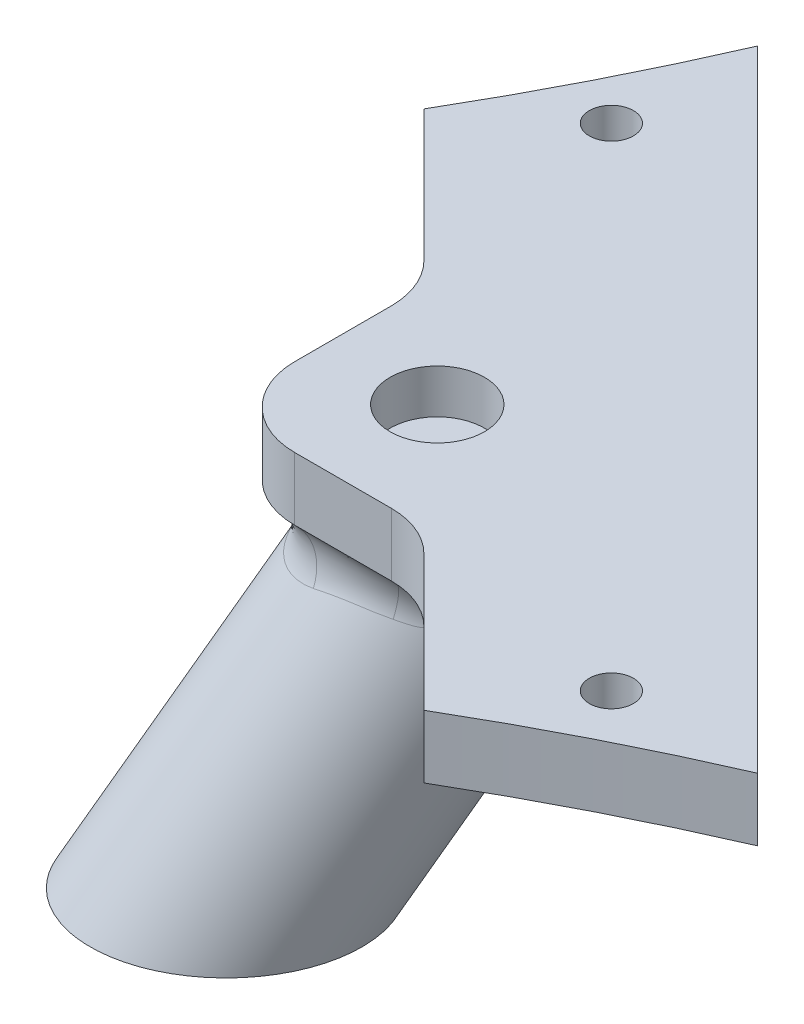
ISO-10303-21;
HEADER;
FILE_DESCRIPTION(('STEP AP214'),'2;1');
FILE_NAME('part.step','',(''),(''),'','','');
FILE_SCHEMA(('AUTOMOTIVE_DESIGN { 1 0 10303 214 1 1 1 1 }'));
ENDSEC;
DATA;
#1=APPLICATION_CONTEXT('core data for automotive mechanical design processes');
#2=APPLICATION_PROTOCOL_DEFINITION('international standard','automotive_design',2000,#1);
#3=PRODUCT_CONTEXT('',#1,'mechanical');
#4=PRODUCT('Part','Part','',(#3));
#5=PRODUCT_RELATED_PRODUCT_CATEGORY('part','',(#4));
#6=PRODUCT_DEFINITION_FORMATION('','',#4);
#7=PRODUCT_DEFINITION_CONTEXT('part definition',#1,'design');
#8=PRODUCT_DEFINITION('design','',#6,#7);
#9=PRODUCT_DEFINITION_SHAPE('','',#8);
#10=(LENGTH_UNIT() NAMED_UNIT(*) SI_UNIT(.MILLI.,.METRE.));
#11=(NAMED_UNIT(*) PLANE_ANGLE_UNIT() SI_UNIT($,.RADIAN.));
#12=(NAMED_UNIT(*) SI_UNIT($,.STERADIAN.) SOLID_ANGLE_UNIT());
#13=UNCERTAINTY_MEASURE_WITH_UNIT(LENGTH_MEASURE(1.E-05),#10,'distance_accuracy_value','');
#14=(GEOMETRIC_REPRESENTATION_CONTEXT(3) GLOBAL_UNCERTAINTY_ASSIGNED_CONTEXT((#13)) GLOBAL_UNIT_ASSIGNED_CONTEXT((#10,
#11,#12)) REPRESENTATION_CONTEXT('',''));
#15=CARTESIAN_POINT('',(0.,0.,0.));
#16=DIRECTION('',(0.,0.,1.));
#17=DIRECTION('',(1.,0.,0.));
#18=AXIS2_PLACEMENT_3D('',#15,#16,#17);
#19=CARTESIAN_POINT('',(-10.6066017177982,-25.9807621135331,10.6066017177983));
#20=DIRECTION('',(0.353553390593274,0.866025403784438,-0.353553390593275));
#21=DIRECTION('',(0.,0.377964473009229,0.925820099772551));
#22=AXIS2_PLACEMENT_3D('',#19,#20,#21);
#23=CYLINDRICAL_SURFACE('',#22,7.);
#24=CARTESIAN_POINT('',(-1.22474487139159,-3.,1.2247448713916));
#25=DIRECTION('',(0.116892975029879,-0.986241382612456,-0.11689297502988));
#26=DIRECTION('',(0.697377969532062,0.165311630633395,-0.697377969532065));
#27=AXIS2_PLACEMENT_3D('',#24,#25,#26);
#28=ELLIPSE('',#27,9.07377172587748,7.);
#29=CARTESIAN_POINT('',(-7.49449235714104,-3.34421342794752,-2.1408287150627));
#30=VERTEX_POINT('',#29);
#31=CARTESIAN_POINT('',(2.14082871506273,-3.34421342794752,7.49449235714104));
#32=VERTEX_POINT('',#31);
#33=EDGE_CURVE('E209',#30,#32,#28,.T.);
#34=ORIENTED_EDGE('',*,*,#33,.T.);
#35=CARTESIAN_POINT('',(2.39029219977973,-3.27546772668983,7.31541327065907));
#36=CARTESIAN_POINT('',(1.89894493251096,0.1801409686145,7.2431528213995));
#37=CARTESIAN_POINT('',(3.94944104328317,0.,10.0628850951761));
#38=CARTESIAN_POINT('',(2.31971672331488,-3.3005739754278,7.36813327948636));
#39=CARTESIAN_POINT('',(1.91206178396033,0.134524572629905,7.21658034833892));
#40=CARTESIAN_POINT('',(3.90747824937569,0.,10.0411548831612));
#41=CARTESIAN_POINT('',(2.24861484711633,-3.3207697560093,7.41950629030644));
#42=CARTESIAN_POINT('',(1.9217893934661,0.083346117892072,7.19510328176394));
#43=CARTESIAN_POINT('',(3.8613436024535,0.,10.0178844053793));
#44=CARTESIAN_POINT('',(2.10588472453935,-3.35231264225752,7.51900498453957));
#45=CARTESIAN_POINT('',(1.9304190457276,-0.0262268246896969,7.16429968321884));
#46=CARTESIAN_POINT('',(3.7594138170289,0.,9.9688661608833));
#47=CARTESIAN_POINT('',(2.03425830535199,-3.36368240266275,7.56713869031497));
#48=CARTESIAN_POINT('',(1.92947304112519,-0.0843573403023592,7.15483239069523));
#49=CARTESIAN_POINT('',(3.70364386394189,0.,9.94312492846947));
#50=CARTESIAN_POINT('',(1.89121377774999,-3.378604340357,7.65950984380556));
#51=CARTESIAN_POINT('',(1.91359253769,-0.203808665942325,7.14914155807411));
#52=CARTESIAN_POINT('',(3.58141693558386,0.,9.88986512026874));
#53=CARTESIAN_POINT('',(1.81979859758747,-3.38221841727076,7.7037754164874));
#54=CARTESIAN_POINT('',(1.89899725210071,-0.264888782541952,7.15262608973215));
#55=CARTESIAN_POINT('',(3.51504915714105,0.,9.86236243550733));
#56=CARTESIAN_POINT('',(1.67670074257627,-3.38317253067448,7.78876692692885));
#57=CARTESIAN_POINT('',(1.85368011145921,-0.386491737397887,7.17197380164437));
#58=CARTESIAN_POINT('',(3.36988238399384,0.,9.80642160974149));
#59=CARTESIAN_POINT('',(1.60501791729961,-3.38050824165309,7.82949040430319));
#60=CARTESIAN_POINT('',(1.82326193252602,-0.446902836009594,7.18761920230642));
#61=CARTESIAN_POINT('',(3.2910748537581,0.,9.77798283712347));
#62=CARTESIAN_POINT('',(1.45869657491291,-3.37028875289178,7.90896104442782));
#63=CARTESIAN_POINT('',(1.74372373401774,-0.565600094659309,7.23027299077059));
#64=CARTESIAN_POINT('',(3.11656642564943,0.,9.72064380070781));
#65=CARTESIAN_POINT('',(1.38404889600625,-3.36255221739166,7.94757502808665));
#66=CARTESIAN_POINT('',(1.69430440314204,-0.62376375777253,7.2574671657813));
#67=CARTESIAN_POINT('',(3.02033894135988,0.,9.69176682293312));
#68=CARTESIAN_POINT('',(1.2342639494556,-3.34402315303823,8.02147698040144));
#69=CARTESIAN_POINT('',(1.57686196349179,-0.732467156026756,7.32037459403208));
#70=CARTESIAN_POINT('',(2.81207179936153,0.,9.63700269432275));
#71=CARTESIAN_POINT('',(1.15912653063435,-3.33322963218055,8.05676386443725));
#72=CARTESIAN_POINT('',(1.50920463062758,-0.783129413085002,7.35591875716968));
#73=CARTESIAN_POINT('',(2.70002701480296,0.,9.61111651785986));
#74=CARTESIAN_POINT('',(1.0080445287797,-3.31080495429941,8.12456814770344));
#75=CARTESIAN_POINT('',(1.35632782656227,-0.875201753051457,7.43232311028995));
#76=CARTESIAN_POINT('',(2.45972063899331,0.,9.56536540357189));
#77=CARTESIAN_POINT('',(0.932100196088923,-3.29917405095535,8.15708637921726));
#78=CARTESIAN_POINT('',(1.27136959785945,-0.91681969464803,7.47311648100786));
#79=CARTESIAN_POINT('',(2.33146395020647,0.,9.54549865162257));
#80=CARTESIAN_POINT('',(0.778947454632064,-3.27743903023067,8.2200821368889));
#81=CARTESIAN_POINT('',(1.085592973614,-0.990550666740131,7.55699129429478));
#82=CARTESIAN_POINT('',(2.05927445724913,0.,9.51534234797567));
#83=CARTESIAN_POINT('',(0.701739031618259,-3.26733493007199,8.25055964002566));
#84=CARTESIAN_POINT('',(0.984834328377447,-1.02289618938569,7.60012477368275));
#85=CARTESIAN_POINT('',(1.9153414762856,0.,9.50505290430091));
#86=CARTESIAN_POINT('',(0.543824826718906,-3.25086798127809,8.31095555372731));
#87=CARTESIAN_POINT('',(0.767211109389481,-1.07943484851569,7.68700831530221));
#88=CARTESIAN_POINT('',(1.61034010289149,0.,9.49774022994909));
#89=CARTESIAN_POINT('',(0.463079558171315,-3.24460027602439,8.34084321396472));
#90=CARTESIAN_POINT('',(0.649777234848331,-1.10364936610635,7.73092604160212));
#91=CARTESIAN_POINT('',(1.44894449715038,0.,9.50103979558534));
#92=CARTESIAN_POINT('',(0.299756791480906,-3.23856432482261,8.40003710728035));
#93=CARTESIAN_POINT('',(0.403870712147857,-1.14409237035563,7.81585432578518));
#94=CARTESIAN_POINT('',(1.11655696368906,0.,9.52519039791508));
#95=CARTESIAN_POINT('',(0.217180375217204,-3.23879233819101,8.42934366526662));
#96=CARTESIAN_POINT('',(0.27489239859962,-1.16049776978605,7.85710379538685));
#97=CARTESIAN_POINT('',(0.945570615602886,0.,9.5460313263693));
#98=CARTESIAN_POINT('',(0.0917241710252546,-3.24523936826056,8.47340972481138));
#99=CARTESIAN_POINT('',(0.075289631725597,-1.18007495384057,7.91549263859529));
#100=CARTESIAN_POINT('',(0.686134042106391,0.,9.59193531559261));
#101=CARTESIAN_POINT('',(0.0494403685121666,-3.24843511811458,8.48818486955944));
#102=CARTESIAN_POINT('',(0.00734466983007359,-1.18578862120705,7.93447732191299));
#103=CARTESIAN_POINT('',(0.598750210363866,0.,9.60979446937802));
#104=CARTESIAN_POINT('',(-0.0354788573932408,-3.25698250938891,8.51776326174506));
#105=CARTESIAN_POINT('',(-0.12991358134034,-1.1955838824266,7.97099672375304));
#106=CARTESIAN_POINT('',(0.424230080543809,0.,9.65040595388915));
#107=CARTESIAN_POINT('',(-0.0781142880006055,-3.26233419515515,8.53256650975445));
#108=CARTESIAN_POINT('',(-0.199335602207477,-1.19967355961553,7.98856071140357));
#109=CARTESIAN_POINT('',(0.337093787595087,0.,9.6731583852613));
#110=CARTESIAN_POINT('',(-0.163768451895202,-3.27523956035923,8.56225686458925));
#111=CARTESIAN_POINT('',(-0.339177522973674,-1.20626823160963,8.02206810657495));
#112=CARTESIAN_POINT('',(0.163842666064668,0.,9.72346165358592));
#113=CARTESIAN_POINT('',(-0.206787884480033,-3.28279880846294,8.57714408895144));
#114=CARTESIAN_POINT('',(-0.40971455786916,-1.20877229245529,8.03803222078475));
#115=CARTESIAN_POINT('',(0.0777310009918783,0.,9.75102455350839));
#116=CARTESIAN_POINT('',(-0.293026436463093,-3.30003724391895,8.60695698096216));
#117=CARTESIAN_POINT('',(-0.551069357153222,-1.2121514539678,8.06811145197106));
#118=CARTESIAN_POINT('',(-0.0923343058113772,0.,9.81053922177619));
#119=CARTESIAN_POINT('',(-0.336245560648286,-3.30971648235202,8.62188264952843));
#120=CARTESIAN_POINT('',(-0.62200188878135,-1.21302429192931,8.08224514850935));
#121=CARTESIAN_POINT('',(-0.176287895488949,0.,9.84249109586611));
#122=CARTESIAN_POINT('',(-0.379525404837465,-3.32041713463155,8.63682321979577));
#123=CARTESIAN_POINT('',(-0.692630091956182,-1.21305632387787,8.09531894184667));
#124=CARTESIAN_POINT('',(-0.258705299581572,0.,9.87645190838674));
#125=(BOUNDED_SURFACE() B_SPLINE_SURFACE(3,2,((#35,#36,#37),(#38,#39,#40),(#41,#42,#43),(#44,
#45,#46),(#47,#48,#49),(#50,#51,#52),(#53,#54,#55),(#56,#57,#58),(#59,#60,#61),(#62,#63,#64),
(#65,#66,#67),(#68,#69,#70),(#71,#72,#73),(#74,#75,#76),(#77,#78,#79),(#80,#81,#82),(#83,#84,
#85),(#86,#87,#88),(#89,#90,#91),(#92,#93,#94),(#95,#96,#97),(#98,#99,#100),(#101,#102,#103),
(#104,#105,#106),(#107,#108,#109),(#110,#111,#112),(#113,#114,#115),(#116,#117,#118),(#119,#120,
#121),(#122,#123,#124)),.UNSPECIFIED.,.F.,.F.,.F.) B_SPLINE_SURFACE_WITH_KNOTS((4,2,2,2,2,2,2,2,
2,2,2,2,2,2,4),(3,3),(0.,0.337538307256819,0.674207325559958,1.00817917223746,1.34238117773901,
1.68923498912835,2.03620148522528,2.383063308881,2.72992904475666,3.08508125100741,
3.4400289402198,3.61917182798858,3.79831840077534,3.97792084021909,4.15752760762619),(0.,1.),
.UNSPECIFIED.) GEOMETRIC_REPRESENTATION_ITEM() RATIONAL_B_SPLINE_SURFACE(((1.,0.65174476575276,
1.),(1.,0.655052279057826,1.),(1.,0.658846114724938,1.),(1.,0.667351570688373,1.),(1.,
0.672060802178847,1.),(1.,0.682318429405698,1.),(1.,0.687859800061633,1.),(1.,0.699654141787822,
1.),(1.,0.705907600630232,1.),(1.,0.719126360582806,1.),(1.,0.726109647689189,1.),(1.,
0.740213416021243,1.),(1.,0.747333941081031,1.),(1.,0.761255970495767,1.),(1.,0.768057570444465,
1.),(1.,0.780824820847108,1.),(1.,0.786790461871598,1.),(1.,0.797457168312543,1.),(1.,
0.802124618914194,1.),(1.,0.809432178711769,1.),(1.,0.812073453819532,1.),(1.,0.814214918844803,
1.),(1.,0.814622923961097,1.),(1.,0.814792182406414,1.),(1.,0.814553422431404,1.),(1.,
0.813414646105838,1.),(1.,0.812512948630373,1.),(1.,0.810057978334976,1.),(1.,0.808504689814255,
1.),(1.,0.806631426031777,1.))) REPRESENTATION_ITEM('') SURFACE());
#126=CARTESIAN_POINT('',(2.39029219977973,-3.27546772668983,7.31541327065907));
#127=CARTESIAN_POINT('',(2.31971672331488,-3.3005739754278,7.36813327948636));
#128=CARTESIAN_POINT('',(2.24861484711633,-3.3207697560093,7.41950629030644));
#129=CARTESIAN_POINT('',(2.10588472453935,-3.35231264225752,7.51900498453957));
#130=CARTESIAN_POINT('',(2.03425830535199,-3.36368240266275,7.56713869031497));
#131=CARTESIAN_POINT('',(1.89121377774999,-3.378604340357,7.65950984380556));
#132=CARTESIAN_POINT('',(1.81979859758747,-3.38221841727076,7.7037754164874));
#133=CARTESIAN_POINT('',(1.67670074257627,-3.38317253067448,7.78876692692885));
#134=CARTESIAN_POINT('',(1.60501791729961,-3.38050824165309,7.82949040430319));
#135=CARTESIAN_POINT('',(1.45869657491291,-3.37028875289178,7.90896104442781));
#136=CARTESIAN_POINT('',(1.38404889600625,-3.36255221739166,7.94757502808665));
#137=CARTESIAN_POINT('',(1.2342639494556,-3.34402315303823,8.02147698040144));
#138=CARTESIAN_POINT('',(1.15912653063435,-3.33322963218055,8.05676386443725));
#139=CARTESIAN_POINT('',(1.0080445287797,-3.31080495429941,8.12456814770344));
#140=CARTESIAN_POINT('',(0.932100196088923,-3.29917405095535,8.15708637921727));
#141=CARTESIAN_POINT('',(0.778947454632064,-3.27743903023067,8.2200821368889));
#142=CARTESIAN_POINT('',(0.701739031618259,-3.267334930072,8.25055964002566));
#143=CARTESIAN_POINT('',(0.543824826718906,-3.25086798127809,8.31095555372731));
#144=CARTESIAN_POINT('',(0.463079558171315,-3.24460027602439,8.34084321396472));
#145=CARTESIAN_POINT('',(0.299756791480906,-3.23856432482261,8.40003710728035));
#146=CARTESIAN_POINT('',(0.217180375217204,-3.23879233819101,8.42934366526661));
#147=CARTESIAN_POINT('',(0.0917241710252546,-3.24523936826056,8.47340972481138));
#148=CARTESIAN_POINT('',(0.0494403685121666,-3.24843511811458,8.48818486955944));
#149=CARTESIAN_POINT('',(-0.0354788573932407,-3.25698250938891,8.51776326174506));
#150=CARTESIAN_POINT('',(-0.0781142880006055,-3.26233419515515,8.53256650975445));
#151=CARTESIAN_POINT('',(-0.163768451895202,-3.27523956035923,8.56225686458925));
#152=CARTESIAN_POINT('',(-0.206787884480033,-3.28279880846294,8.57714408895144));
#153=CARTESIAN_POINT('',(-0.293026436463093,-3.30003724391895,8.60695698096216));
#154=CARTESIAN_POINT('',(-0.336245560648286,-3.30971648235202,8.62188264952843));
#155=CARTESIAN_POINT('',(-0.379525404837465,-3.32041713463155,8.63682321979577));
#156=B_SPLINE_CURVE_WITH_KNOTS('',3,(#126,#127,#128,#129,#130,#131,#132,#133,#134,#135,#136,
#137,#138,#139,#140,#141,#142,#143,#144,#145,#146,#147,#148,#149,#150,#151,#152,#153,#154,#155),
.UNSPECIFIED.,.F.,.F.,(4,2,2,2,2,2,2,2,2,2,2,2,2,2,4),(0.,0.337538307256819,0.674207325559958,
1.00817917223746,1.34238117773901,1.68923498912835,2.03620148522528,2.383063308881,
2.72992904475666,3.08508125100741,3.4400289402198,3.61917182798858,3.79831840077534,
3.97792084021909,4.15752760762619),.UNSPECIFIED.);
#157=CARTESIAN_POINT('',(0.562123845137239,-3.25321845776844,8.30376695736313));
#158=VERTEX_POINT('',#157);
#159=EDGE_CURVE('E380',#32,#158,#156,.T.);
#160=ORIENTED_EDGE('',*,*,#159,.T.);
#161=CARTESIAN_POINT('',(2.58464570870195,-3.25261962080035,7.17242617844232));
#162=CARTESIAN_POINT('',(2.46126742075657,-0.0632522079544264,6.92716916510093));
#163=CARTESIAN_POINT('',(4.36494238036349,0.,9.50000000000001));
#164=CARTESIAN_POINT('',(2.44406828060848,-3.27892085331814,7.27951973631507));
#165=CARTESIAN_POINT('',(2.37951314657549,-0.177986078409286,6.96178349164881));
#166=CARTESIAN_POINT('',(4.18083688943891,0.,9.50000000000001));
#167=CARTESIAN_POINT('',(2.30167951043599,-3.29664692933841,7.38158003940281));
#168=CARTESIAN_POINT('',(2.28604609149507,-0.284693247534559,7.00648543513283));
#169=CARTESIAN_POINT('',(3.9928459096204,0.,9.50000000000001));
#170=CARTESIAN_POINT('',(2.01378643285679,-3.31866694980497,7.57493848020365));
#171=CARTESIAN_POINT('',(2.08064407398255,-0.477767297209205,7.10755119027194));
#172=CARTESIAN_POINT('',(3.61024094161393,0.,9.50000000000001));
#173=CARTESIAN_POINT('',(1.86828904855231,-3.3229881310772,7.66625807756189));
#174=CARTESIAN_POINT('',(1.96905164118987,-0.564838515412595,7.16367636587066));
#175=CARTESIAN_POINT('',(3.41564119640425,0.,9.50000000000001));
#176=CARTESIAN_POINT('',(1.5747210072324,-3.32199512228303,7.83752393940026));
#177=CARTESIAN_POINT('',(1.73013627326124,-0.71916794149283,7.28054262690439));
#178=CARTESIAN_POINT('',(3.02102979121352,0.,9.50000000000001));
#179=CARTESIAN_POINT('',(1.42666348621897,-3.31672072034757,7.91751569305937));
#180=CARTESIAN_POINT('',(1.60301695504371,-0.787089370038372,7.34126574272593));
#181=CARTESIAN_POINT('',(2.82104385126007,0.,9.50000000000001));
#182=CARTESIAN_POINT('',(1.12739297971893,-3.30008987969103,8.06672491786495));
#183=CARTESIAN_POINT('',(1.334960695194,-0.906084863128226,7.46214663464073));
#184=CARTESIAN_POINT('',(2.41535791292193,0.,9.50000000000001));
#185=CARTESIAN_POINT('',(0.97617809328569,-3.28872966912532,8.13593567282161));
#186=CARTESIAN_POINT('',(1.19397739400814,-0.95761993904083,7.52245556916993));
#187=CARTESIAN_POINT('',(2.20965444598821,0.,9.50000000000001));
#188=CARTESIAN_POINT('',(0.620069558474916,-3.25900378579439,8.28509778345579));
#189=CARTESIAN_POINT('',(0.852570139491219,-1.06122011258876,7.65719582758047));
#190=CARTESIAN_POINT('',(1.72409532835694,0.,9.50000000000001));
#191=CARTESIAN_POINT('',(0.413992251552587,-3.23956412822,8.36100882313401));
#192=CARTESIAN_POINT('',(0.646268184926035,-1.10890635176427,7.73066051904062));
#193=CARTESIAN_POINT('',(1.44225477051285,0.,9.50000000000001));
#194=CARTESIAN_POINT('',(-0.00343902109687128,-3.20292225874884,8.49567275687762));
#195=CARTESIAN_POINT('',(0.217595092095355,-1.18701560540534,7.86242223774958));
#196=CARTESIAN_POINT('',(0.870692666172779,0.,9.50000000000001));
#197=CARTESIAN_POINT('',(-0.21479359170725,-3.18572030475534,8.55442367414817));
#198=CARTESIAN_POINT('',(-0.00559093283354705,-1.21792964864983,7.92131085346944));
#199=CARTESIAN_POINT('',(0.580970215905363,0.,9.50000000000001));
#200=CARTESIAN_POINT('',(-0.642297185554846,-3.15974519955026,8.65643806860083));
#201=CARTESIAN_POINT('',(-0.463444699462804,-1.26962662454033,8.01988858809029));
#202=CARTESIAN_POINT('',(-0.0047906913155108,0.,9.50000000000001));
#203=CARTESIAN_POINT('',(-0.85844336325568,-3.15096717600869,8.69971048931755));
#204=CARTESIAN_POINT('',(-0.699234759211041,-1.29067465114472,8.06008175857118));
#205=CARTESIAN_POINT('',(-0.300825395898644,0.,9.50000000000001));
#206=CARTESIAN_POINT('',(-1.29477958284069,-3.14652547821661,8.77247435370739));
#207=CARTESIAN_POINT('',(-1.17777541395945,-1.32824080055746,8.11903210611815));
#208=CARTESIAN_POINT('',(-0.89747248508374,0.,9.50000000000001));
#209=CARTESIAN_POINT('',(-1.51496900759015,-3.15085981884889,8.80196788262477));
#210=CARTESIAN_POINT('',(-1.42189917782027,-1.34489670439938,8.13809012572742));
#211=CARTESIAN_POINT('',(-1.19808416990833,0.,9.50000000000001));
#212=CARTESIAN_POINT('',(-1.95767312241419,-3.17522727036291,8.84847647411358));
#213=CARTESIAN_POINT('',(-1.9117815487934,-1.37701095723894,8.15354225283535));
#214=CARTESIAN_POINT('',(-1.8011132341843,0.,9.50000000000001));
#215=CARTESIAN_POINT('',(-2.18018303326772,-3.19523271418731,8.8655134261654));
#216=CARTESIAN_POINT('',(-2.15905588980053,-1.39257057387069,8.15001731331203));
#217=CARTESIAN_POINT('',(-2.10352650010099,0.,9.50000000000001));
#218=CARTESIAN_POINT('',(-2.62624442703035,-3.25113808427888,8.88792766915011));
#219=CARTESIAN_POINT('',(-2.65054835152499,-1.42329269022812,8.11968488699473));
#220=CARTESIAN_POINT('',(-2.70832410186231,0.,9.50000000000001));
#221=CARTESIAN_POINT('',(-2.8497960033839,-3.28703946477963,8.89330389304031));
#222=CARTESIAN_POINT('',(-2.89632755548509,-1.43855137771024,8.09262250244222));
#223=CARTESIAN_POINT('',(-3.01070843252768,0.,9.50000000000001));
#224=CARTESIAN_POINT('',(-3.29682035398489,-3.37301444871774,8.89238567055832));
#225=CARTESIAN_POINT('',(-3.3801550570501,-1.46693199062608,8.01449200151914));
#226=CARTESIAN_POINT('',(-3.61413423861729,0.,9.50000000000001));
#227=CARTESIAN_POINT('',(-3.52029122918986,-3.42312666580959,8.88605916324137));
#228=CARTESIAN_POINT('',(-3.61967641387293,-1.48011293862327,7.96277515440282));
#229=CARTESIAN_POINT('',(-3.91516975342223,0.,9.50000000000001));
#230=CARTESIAN_POINT('',(-3.96500507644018,-3.53423366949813,8.86089274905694));
#231=CARTESIAN_POINT('',(-4.08441918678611,-1.50010832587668,7.83455372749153));
#232=CARTESIAN_POINT('',(-4.51341973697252,0.,9.50000000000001));
#233=CARTESIAN_POINT('',(-4.186247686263,-3.59523019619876,8.84205084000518));
#234=CARTESIAN_POINT('',(-4.3109585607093,-1.50685860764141,7.75708170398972));
#235=CARTESIAN_POINT('',(-4.81063358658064,0.,9.50000000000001));
#236=CARTESIAN_POINT('',(-4.59251237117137,-3.71445940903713,8.79413043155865));
#237=CARTESIAN_POINT('',(-4.70950026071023,-1.50727814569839,7.59040972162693));
#238=CARTESIAN_POINT('',(-5.35616911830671,0.,9.50000000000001));
#239=CARTESIAN_POINT('',(-4.77805416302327,-3.77176778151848,8.76697686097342));
#240=CARTESIAN_POINT('',(-4.88596518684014,-1.50248343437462,7.50340422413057));
#241=CARTESIAN_POINT('',(-5.6052235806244,0.,9.50000000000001));
#242=CARTESIAN_POINT('',(-5.1452385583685,-3.88830634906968,8.70106562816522));
#243=CARTESIAN_POINT('',(-5.21652438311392,-1.47745710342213,7.31098509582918));
#244=CARTESIAN_POINT('',(-6.09834058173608,0.,9.50000000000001));
#245=CARTESIAN_POINT('',(-5.32688373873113,-3.9475352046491,8.66231590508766));
#246=CARTESIAN_POINT('',(-5.37087135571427,-1.45667875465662,7.20445636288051));
#247=CARTESIAN_POINT('',(-6.3424064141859,0.,9.50000000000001));
#248=CARTESIAN_POINT('',(-5.68421380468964,-4.06423919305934,8.5715438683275));
#249=CARTESIAN_POINT('',(-5.6469373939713,-1.3916724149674,6.97518059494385));
#250=CARTESIAN_POINT('',(-6.82328383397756,0.,9.50000000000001));
#251=CARTESIAN_POINT('',(-5.85992403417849,-4.12172163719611,8.51958916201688));
#252=CARTESIAN_POINT('',(-5.76842562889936,-1.34644242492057,6.85115551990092));
#253=CARTESIAN_POINT('',(-7.06012568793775,0.,9.50000000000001));
#254=CARTESIAN_POINT('',(-6.11838280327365,-4.20367131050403,8.42976719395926));
#255=CARTESIAN_POINT('',(-5.91414913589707,-1.25393537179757,6.65940814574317));
#256=CARTESIAN_POINT('',(-7.40956473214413,0.,9.50000000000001));
#257=CARTESIAN_POINT('',(-6.20376945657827,-4.23030061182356,8.39780603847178));
#258=CARTESIAN_POINT('',(-5.95720769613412,-1.21803641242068,6.59312726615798));
#259=CARTESIAN_POINT('',(-7.52518921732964,0.,9.50000000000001));
#260=CARTESIAN_POINT('',(-6.37247187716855,-4.28141688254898,8.32951795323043));
#261=CARTESIAN_POINT('',(-6.02877485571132,-1.13574648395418,6.45961777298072));
#262=CARTESIAN_POINT('',(-7.75410572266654,0.,9.50000000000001));
#263=CARTESIAN_POINT('',(-6.4557866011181,-4.30590278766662,8.29318887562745));
#264=CARTESIAN_POINT('',(-6.05694783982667,-1.08901486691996,6.39226551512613));
#265=CARTESIAN_POINT('',(-7.86739656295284,0.,9.50000000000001));
#266=CARTESIAN_POINT('',(-6.53787170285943,-4.32895680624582,8.25448795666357));
#267=CARTESIAN_POINT('',(-6.07587391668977,-1.03676381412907,6.32647686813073));
#268=CARTESIAN_POINT('',(-7.97931163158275,0.,9.50000000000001));
#269=(BOUNDED_SURFACE() B_SPLINE_SURFACE(3,2,((#161,#162,#163),(#164,#165,#166),(#167,#168,
#169),(#170,#171,#172),(#173,#174,#175),(#176,#177,#178),(#179,#180,#181),(#182,#183,#184),
(#185,#186,#187),(#188,#189,#190),(#191,#192,#193),(#194,#195,#196),(#197,#198,#199),(#200,#201,
#202),(#203,#204,#205),(#206,#207,#208),(#209,#210,#211),(#212,#213,#214),(#215,#216,#217),
(#218,#219,#220),(#221,#222,#223),(#224,#225,#226),(#227,#228,#229),(#230,#231,#232),(#233,#234,
#235),(#236,#237,#238),(#239,#240,#241),(#242,#243,#244),(#245,#246,#247),(#248,#249,#250),
(#251,#252,#253),(#254,#255,#256),(#257,#258,#259),(#260,#261,#262),(#263,#264,#265),(#266,#267,
#268)),.UNSPECIFIED.,.F.,.F.,.F.) B_SPLINE_SURFACE_WITH_KNOTS((4,2,2,2,2,2,2,2,2,2,2,2,2,2,2,2,
2,4),(3,3),(0.,0.686594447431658,1.37179291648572,2.05415667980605,2.73694384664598,
3.64597973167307,4.5551202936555,5.46373469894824,6.37221155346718,7.27908811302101,
8.18604765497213,9.09549559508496,10.0050890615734,10.7802237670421,11.5548289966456,
12.3255455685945,12.711695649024,13.0980363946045),(0.,1.),
.UNSPECIFIED.) GEOMETRIC_REPRESENTATION_ITEM() RATIONAL_B_SPLINE_SURFACE(((1.,0.683808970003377,
1.),(1.,0.693593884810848,1.),(1.,0.703148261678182,1.),(1.,0.721626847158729,1.),(1.,
0.73055229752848,1.),(1.,0.747609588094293,1.),(1.,0.755744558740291,1.),(1.,0.771126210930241,
1.),(1.,0.778372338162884,1.),(1.,0.794074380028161,1.),(1.,0.802135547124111,1.),(1.,
0.816175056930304,1.),(1.,0.822153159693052,1.),(1.,0.831796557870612,1.),(1.,0.835463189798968,
1.),(1.,0.840307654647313,1.),(1.,0.841485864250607,1.),(1.,0.841229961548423,1.),(1.,
0.839800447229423,1.),(1.,0.834269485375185,1.),(1.,0.830167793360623,1.),(1.,0.819246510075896,
1.),(1.,0.812419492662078,1.),(1.,0.796023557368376,1.),(1.,0.78645420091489,1.),(1.,
0.766160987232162,1.),(1.,0.755816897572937,1.),(1.,0.733095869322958,1.),(1.,0.72072032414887,
1.),(1.,0.693983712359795,1.),(1.,0.679632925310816,1.),(1.,0.656617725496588,1.),(1.,
0.648688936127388,1.),(1.,0.632360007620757,1.),(1.,0.623959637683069,1.),(1.,0.615338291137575,1.))) REPRESENTATION_ITEM('') SURFACE());
#270=CARTESIAN_POINT('',(2.58464570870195,-3.25261962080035,7.17242617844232));
#271=CARTESIAN_POINT('',(2.44406828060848,-3.27892085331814,7.27951973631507));
#272=CARTESIAN_POINT('',(2.30167951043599,-3.29664692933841,7.38158003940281));
#273=CARTESIAN_POINT('',(2.01378643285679,-3.31866694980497,7.57493848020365));
#274=CARTESIAN_POINT('',(1.86828904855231,-3.3229881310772,7.66625807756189));
#275=CARTESIAN_POINT('',(1.5747210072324,-3.32199512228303,7.83752393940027));
#276=CARTESIAN_POINT('',(1.42666348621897,-3.31672072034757,7.91751569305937));
#277=CARTESIAN_POINT('',(1.12739297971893,-3.30008987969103,8.06672491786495));
#278=CARTESIAN_POINT('',(0.97617809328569,-3.28872966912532,8.13593567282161));
#279=CARTESIAN_POINT('',(0.620069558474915,-3.25900378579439,8.28509778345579));
#280=CARTESIAN_POINT('',(0.413992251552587,-3.23956412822,8.36100882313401));
#281=CARTESIAN_POINT('',(-0.0034390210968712,-3.20292225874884,8.49567275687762));
#282=CARTESIAN_POINT('',(-0.21479359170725,-3.18572030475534,8.55442367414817));
#283=CARTESIAN_POINT('',(-0.642297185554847,-3.15974519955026,8.65643806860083));
#284=CARTESIAN_POINT('',(-0.85844336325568,-3.15096717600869,8.69971048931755));
#285=CARTESIAN_POINT('',(-1.29477958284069,-3.14652547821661,8.77247435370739));
#286=CARTESIAN_POINT('',(-1.51496900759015,-3.15085981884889,8.80196788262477));
#287=CARTESIAN_POINT('',(-1.95767312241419,-3.17522727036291,8.84847647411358));
#288=CARTESIAN_POINT('',(-2.18018303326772,-3.19523271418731,8.8655134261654));
#289=CARTESIAN_POINT('',(-2.62624442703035,-3.25113808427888,8.88792766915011));
#290=CARTESIAN_POINT('',(-2.8497960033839,-3.28703946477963,8.89330389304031));
#291=CARTESIAN_POINT('',(-3.29682035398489,-3.37301444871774,8.89238567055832));
#292=CARTESIAN_POINT('',(-3.52029122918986,-3.42312666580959,8.88605916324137));
#293=CARTESIAN_POINT('',(-3.96500507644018,-3.53423366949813,8.86089274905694));
#294=CARTESIAN_POINT('',(-4.186247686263,-3.59523019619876,8.84205084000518));
#295=CARTESIAN_POINT('',(-4.59251237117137,-3.71445940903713,8.79413043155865));
#296=CARTESIAN_POINT('',(-4.77805416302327,-3.77176778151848,8.76697686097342));
#297=CARTESIAN_POINT('',(-5.1452385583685,-3.88830634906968,8.70106562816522));
#298=CARTESIAN_POINT('',(-5.32688373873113,-3.9475352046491,8.66231590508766));
#299=CARTESIAN_POINT('',(-5.68421380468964,-4.06423919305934,8.5715438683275));
#300=CARTESIAN_POINT('',(-5.85992403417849,-4.12172163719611,8.51958916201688));
#301=CARTESIAN_POINT('',(-6.11838280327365,-4.20367131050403,8.42976719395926));
#302=CARTESIAN_POINT('',(-6.20376945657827,-4.23030061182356,8.39780603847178));
#303=CARTESIAN_POINT('',(-6.37247187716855,-4.28141688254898,8.32951795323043));
#304=CARTESIAN_POINT('',(-6.45578660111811,-4.30590278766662,8.29318887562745));
#305=CARTESIAN_POINT('',(-6.53787170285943,-4.32895680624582,8.25448795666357));
#306=B_SPLINE_CURVE_WITH_KNOTS('',3,(#270,#271,#272,#273,#274,#275,#276,#277,#278,#279,#280,
#281,#282,#283,#284,#285,#286,#287,#288,#289,#290,#291,#292,#293,#294,#295,#296,#297,#298,#299,
#300,#301,#302,#303,#304,#305),.UNSPECIFIED.,.F.,.F.,(4,2,2,2,2,2,2,2,2,2,2,2,2,2,2,2,2,4),(0.,
0.686594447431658,1.37179291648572,2.05415667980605,2.73694384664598,3.64597973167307,
4.5551202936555,5.46373469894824,6.37221155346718,7.27908811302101,8.18604765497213,
9.09549559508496,10.0050890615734,10.7802237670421,11.5548289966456,12.3255455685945,
12.711695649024,13.0980363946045),.UNSPECIFIED.);
#307=CARTESIAN_POINT('',(-3.95511541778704,-3.53344568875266,8.85949008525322));
#308=VERTEX_POINT('',#307);
#309=EDGE_CURVE('E388',#158,#308,#306,.T.);
#310=ORIENTED_EDGE('',*,*,#309,.T.);
#311=CARTESIAN_POINT('',(-2.79507497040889,-3.16407145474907,8.84038932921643));
#312=CARTESIAN_POINT('',(-3.18321863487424,-1.4149177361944,8.06243067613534));
#313=CARTESIAN_POINT('',(-3.43513678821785,0.,9.38529081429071));
#314=CARTESIAN_POINT('',(-2.94182306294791,-3.21960331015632,8.85589441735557));
#315=CARTESIAN_POINT('',(-3.30085326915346,-1.42990921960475,8.04295553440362));
#316=CARTESIAN_POINT('',(-3.56336907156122,0.,9.41327328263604));
#317=CARTESIAN_POINT('',(-3.08868392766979,-3.27139788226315,8.86652043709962));
#318=CARTESIAN_POINT('',(-3.41593886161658,-1.44284200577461,8.01973877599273));
#319=CARTESIAN_POINT('',(-3.69433245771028,0.,9.43649954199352));
#320=CARTESIAN_POINT('',(-3.38180908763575,-3.36826454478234,8.87785171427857));
#321=CARTESIAN_POINT('',(-3.6422805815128,-1.46552531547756,7.96631563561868));
#322=CARTESIAN_POINT('',(-3.96055975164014,0.,9.47262176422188));
#323=CARTESIAN_POINT('',(-3.5280734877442,-3.41333787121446,8.87855879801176));
#324=CARTESIAN_POINT('',(-3.75340809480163,-1.47522612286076,7.93603573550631));
#325=CARTESIAN_POINT('',(-4.09582286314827,0.,9.48551962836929));
#326=CARTESIAN_POINT('',(-3.81948151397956,-3.49760436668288,8.86988816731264));
#327=CARTESIAN_POINT('',(-3.97141040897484,-1.49213852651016,7.86910461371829));
#328=CARTESIAN_POINT('',(-4.36976468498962,0.,9.50019033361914));
#329=CARTESIAN_POINT('',(-3.96462285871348,-3.53678758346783,8.86049359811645));
#330=CARTESIAN_POINT('',(-4.07812345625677,-1.49930618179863,7.83239144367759));
#331=CARTESIAN_POINT('',(-4.50844872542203,0.,9.50194454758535));
#332=CARTESIAN_POINT('',(-4.25278365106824,-3.60974458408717,8.83149246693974));
#333=CARTESIAN_POINT('',(-4.28675230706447,-1.51165833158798,7.75334763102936));
#334=CARTESIAN_POINT('',(-4.78777044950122,0.,9.49366719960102));
#335=CARTESIAN_POINT('',(-4.39580280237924,-3.64351761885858,8.8118844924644));
#336=CARTESIAN_POINT('',(-4.3885018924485,-1.51681217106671,7.71098888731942));
#337=CARTESIAN_POINT('',(-4.92840840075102,0.,9.48363400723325));
#338=CARTESIAN_POINT('',(-4.70562763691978,-3.71200175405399,8.75773927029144));
#339=CARTESIAN_POINT('',(-4.60592750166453,-1.52643167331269,7.61285689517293));
#340=CARTESIAN_POINT('',(-5.23686956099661,0.,9.44827602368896));
#341=CARTESIAN_POINT('',(-4.87183939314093,-3.74569125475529,8.72108559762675));
#342=CARTESIAN_POINT('',(-4.72008094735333,-1.53053863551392,7.55617848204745));
#343=CARTESIAN_POINT('',(-5.40482352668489,0.,9.42042683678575));
#344=CARTESIAN_POINT('',(-5.19888740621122,-3.80664534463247,8.63331061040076));
#345=CARTESIAN_POINT('',(-4.94136925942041,-1.53722525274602,7.43714818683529));
#346=CARTESIAN_POINT('',(-5.73926988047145,0.,9.34701210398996));
#347=CARTESIAN_POINT('',(-5.3597234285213,-3.83390965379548,8.582188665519));
#348=CARTESIAN_POINT('',(-5.04821364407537,-1.5397805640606,7.37484072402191));
#349=CARTESIAN_POINT('',(-5.90576220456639,0.,9.30144578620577));
#350=CARTESIAN_POINT('',(-5.67469651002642,-3.88243647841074,8.46566788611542));
#351=CARTESIAN_POINT('',(-5.2552016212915,-1.54384921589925,7.24562067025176));
#352=CARTESIAN_POINT('',(-6.23484265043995,0.,9.19258397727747));
#353=CARTESIAN_POINT('',(-5.82883578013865,-3.90370098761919,8.40027380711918));
#354=CARTESIAN_POINT('',(-5.35506845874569,-1.54534834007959,7.17879612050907));
#355=CARTESIAN_POINT('',(-6.39743205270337,0.,9.12929438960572));
#356=CARTESIAN_POINT('',(-6.12921280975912,-3.94055140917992,8.25552449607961));
#357=CARTESIAN_POINT('',(-5.54875586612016,-1.54767376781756,7.04132365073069));
#358=CARTESIAN_POINT('',(-6.71637613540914,0.,8.98534121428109));
#359=CARTESIAN_POINT('',(-6.2754509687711,-3.95613760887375,8.17616997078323));
#360=CARTESIAN_POINT('',(-5.64231502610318,-1.54849219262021,6.97079718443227));
#361=CARTESIAN_POINT('',(-6.87273113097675,0.,8.90467850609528));
#362=CARTESIAN_POINT('',(-6.55569445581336,-3.9815640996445,8.00588458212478));
#363=CARTESIAN_POINT('',(-5.82216693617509,-1.54970380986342,6.82798463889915));
#364=CARTESIAN_POINT('',(-7.17354953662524,0.,8.72869085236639));
#365=CARTESIAN_POINT('',(-6.68989862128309,-3.9915236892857,7.91524809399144));
#366=CARTESIAN_POINT('',(-5.9083575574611,-1.55010248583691,6.7559031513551));
#367=CARTESIAN_POINT('',(-7.31819931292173,0.,8.63372907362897));
#368=CARTESIAN_POINT('',(-6.94858694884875,-4.00634817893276,7.72165020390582));
#369=CARTESIAN_POINT('',(-6.07653828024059,-1.55066159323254,6.60857946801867));
#370=CARTESIAN_POINT('',(-7.59736959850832,0.,8.42890352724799));
#371=CARTESIAN_POINT('',(-7.07306768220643,-4.01121128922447,7.61868448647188));
#372=CARTESIAN_POINT('',(-6.15831998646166,-1.55082049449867,6.53349428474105));
#373=CARTESIAN_POINT('',(-7.73188653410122,0.,8.31903453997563));
#374=CARTESIAN_POINT('',(-7.31120266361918,-4.01589488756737,7.40126760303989));
#375=CARTESIAN_POINT('',(-6.31830511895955,-1.55097428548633,6.37997570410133));
#376=CARTESIAN_POINT('',(-7.98881013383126,0.,8.08584468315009));
#377=CARTESIAN_POINT('',(-7.42486383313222,-4.01571862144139,7.28682387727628));
#378=CARTESIAN_POINT('',(-6.39632166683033,-1.55096892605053,6.30171869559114));
#379=CARTESIAN_POINT('',(-8.11122454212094,0.,7.96253252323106));
#380=CARTESIAN_POINT('',(-7.64063736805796,-4.01032808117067,7.04721139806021));
#381=CARTESIAN_POINT('',(-6.54937093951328,-1.55079098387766,6.14122165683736));
#382=CARTESIAN_POINT('',(-8.34249152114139,0.,7.70395957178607));
#383=CARTESIAN_POINT('',(-7.7427445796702,-4.0051115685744,6.92203790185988));
#384=CARTESIAN_POINT('',(-6.62422908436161,-1.55061873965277,6.05917034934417));
#385=CARTESIAN_POINT('',(-8.45133804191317,0.,7.56869349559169));
#386=CARTESIAN_POINT('',(-7.9316814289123,-3.98981088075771,6.66597463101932));
#387=CARTESIAN_POINT('',(-6.76888748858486,-1.55003343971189,5.8929407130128));
#388=CARTESIAN_POINT('',(-8.65097540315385,0.,7.29241089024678));
#389=CARTESIAN_POINT('',(-8.01888281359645,-3.97988046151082,6.53537677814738));
#390=CARTESIAN_POINT('',(-6.83861976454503,-1.5496293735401,5.80910530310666));
#391=CARTESIAN_POINT('',(-8.74221665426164,0.,7.15169676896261));
#392=CARTESIAN_POINT('',(-8.18111374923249,-3.9551088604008,6.26610180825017));
#393=CARTESIAN_POINT('',(-6.97527369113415,-1.54843644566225,5.6363049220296));
#394=CARTESIAN_POINT('',(-8.90968357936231,0.,6.86274461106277));
#395=CARTESIAN_POINT('',(-8.25614878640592,-3.94026990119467,6.12742837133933));
#396=CARTESIAN_POINT('',(-7.04207104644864,-1.54765108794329,5.54754843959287));
#397=CARTESIAN_POINT('',(-8.98591602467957,0.,6.7145100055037));
#398=CARTESIAN_POINT('',(-8.39375183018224,-3.90547885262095,5.84283853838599));
#399=CARTESIAN_POINT('',(-7.17250905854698,-1.54546424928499,5.36407323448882));
#400=CARTESIAN_POINT('',(-9.122852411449,0.,6.41227295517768));
#401=CARTESIAN_POINT('',(-8.45630760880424,-3.88552179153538,5.69691521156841));
#402=CARTESIAN_POINT('',(-7.23604325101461,-1.54406885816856,5.26957119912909));
#403=CARTESIAN_POINT('',(-9.18354113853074,0.,6.25826502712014));
#404=CARTESIAN_POINT('',(-8.5685619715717,-3.84024552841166,5.39906534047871));
#405=CARTESIAN_POINT('',(-7.35913892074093,-1.54034090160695,5.07414725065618));
#406=CARTESIAN_POINT('',(-9.2889569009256,0.,5.94669689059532));
#407=CARTESIAN_POINT('',(-8.6182646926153,-3.81492805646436,5.24714074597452));
#408=CARTESIAN_POINT('',(-7.41862545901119,-1.53802063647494,4.97346502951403));
#409=CARTESIAN_POINT('',(-9.33368907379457,0.,5.7891378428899));
#410=CARTESIAN_POINT('',(-8.70543454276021,-3.75807965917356,4.93563489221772));
#411=CARTESIAN_POINT('',(-7.53368690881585,-1.53197205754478,4.76351601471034));
#412=CARTESIAN_POINT('',(-9.40785480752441,0.,5.46969608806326));
#413=CARTESIAN_POINT('',(-8.74267353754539,-3.72644821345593,4.77596637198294));
#414=CARTESIAN_POINT('',(-7.58914245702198,-1.52823978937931,4.65436735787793));
#415=CARTESIAN_POINT('',(-9.43700840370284,0.,5.30778586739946));
#416=CARTESIAN_POINT('',(-8.80366331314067,-3.6567557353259,4.45262946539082));
#417=CARTESIAN_POINT('',(-7.69384343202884,-1.51880534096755,4.42898069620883));
#418=CARTESIAN_POINT('',(-9.47914779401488,0.,4.98443944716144));
#419=CARTESIAN_POINT('',(-8.82741343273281,-3.61869438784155,4.28896088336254));
#420=CARTESIAN_POINT('',(-7.74308494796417,-1.51313460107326,4.31300253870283));
#421=CARTESIAN_POINT('',(-9.49213279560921,0.,4.82300327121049));
#422=CARTESIAN_POINT('',(-8.86147138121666,-3.53552351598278,3.95887435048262));
#423=CARTESIAN_POINT('',(-7.83413449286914,-1.49914871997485,4.07427523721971));
#424=CARTESIAN_POINT('',(-9.50256081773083,0.,4.50272610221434));
#425=CARTESIAN_POINT('',(-8.87178711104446,-3.49041815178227,3.79245807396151));
#426=CARTESIAN_POINT('',(-7.87598615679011,-1.49088013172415,3.95178106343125));
#427=CARTESIAN_POINT('',(-9.50001297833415,0.,4.34388363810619));
#428=CARTESIAN_POINT('',(-8.87917775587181,-3.39222560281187,3.45795829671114));
#429=CARTESIAN_POINT('',(-7.95109220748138,-1.47079242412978,3.70069635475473));
#430=CARTESIAN_POINT('',(-9.48040125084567,0.,4.03055117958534));
#431=CARTESIAN_POINT('',(-8.87625346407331,-3.33913889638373,3.28987489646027));
#432=CARTESIAN_POINT('',(-7.98442997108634,-1.45903548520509,3.57233018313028));
#433=CARTESIAN_POINT('',(-9.46333823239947,0.,3.87606092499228));
#434=CARTESIAN_POINT('',(-8.86679758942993,-3.28160015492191,3.12153582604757));
#435=CARTESIAN_POINT('',(-8.01320466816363,-1.44499228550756,3.4402007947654));
#436=CARTESIAN_POINT('',(-9.43951967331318,0.,3.72466433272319));
#437=(BOUNDED_SURFACE() B_SPLINE_SURFACE(3,2,((#311,#312,#313),(#314,#315,#316),(#317,#318,
#319),(#320,#321,#322),(#323,#324,#325),(#326,#327,#328),(#329,#330,#331),(#332,#333,#334),
(#335,#336,#337),(#338,#339,#340),(#341,#342,#343),(#344,#345,#346),(#347,#348,#349),(#350,#351,
#352),(#353,#354,#355),(#356,#357,#358),(#359,#360,#361),(#362,#363,#364),(#365,#366,#367),
(#368,#369,#370),(#371,#372,#373),(#374,#375,#376),(#377,#378,#379),(#380,#381,#382),(#383,#384,
#385),(#386,#387,#388),(#389,#390,#391),(#392,#393,#394),(#395,#396,#397),(#398,#399,#400),
(#401,#402,#403),(#404,#405,#406),(#407,#408,#409),(#410,#411,#412),(#413,#414,#415),(#416,#417,
#418),(#419,#420,#421),(#422,#423,#424),(#425,#426,#427),(#428,#429,#430),(#431,#432,#433),
(#434,#435,#436)),.UNSPECIFIED.,.F.,.F.,.F.) B_SPLINE_SURFACE_WITH_KNOTS((4,2,2,2,2,2,2,2,2,2,2,
2,2,2,2,2,2,2,2,2,4),(3,3),(0.,0.593492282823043,1.18687528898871,1.78124990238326,
2.3757067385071,3.08213767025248,3.78859938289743,4.49482605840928,5.20101699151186,
5.89161137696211,6.58244819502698,7.27284006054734,7.96353868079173,8.63311244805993,
9.30238343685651,9.9723070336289,10.6420147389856,11.3233843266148,12.0047873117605,
12.685789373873,13.3667506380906),(0.,1.),
.UNSPECIFIED.) GEOMETRIC_REPRESENTATION_ITEM() RATIONAL_B_SPLINE_SURFACE(((1.,0.838021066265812,
1.),(1.,0.832358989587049,1.),(1.,0.826806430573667,1.),(1.,0.815984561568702,1.),(1.,
0.810715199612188,1.),(1.,0.800513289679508,1.),(1.,0.795581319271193,1.),(1.,0.786117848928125,
1.),(1.,0.78158640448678,1.),(1.,0.772161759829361,1.),(1.,0.767361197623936,1.),(1.,
0.758466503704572,1.),(1.,0.754372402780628,1.),(1.,0.746950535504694,1.),(1.,0.743622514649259,
1.),(1.,0.737778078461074,1.),(1.,0.735261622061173,1.),(1.,0.731121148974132,1.),(1.,
0.729478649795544,1.),(1.,0.727023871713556,1.),(1.,0.726211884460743,1.),(1.,0.725429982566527,
1.),(1.,0.725459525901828,1.),(1.,0.726359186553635,1.),(1.,0.72722967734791,1.),(1.,
0.729761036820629,1.),(1.,0.731396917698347,1.),(1.,0.735427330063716,1.),(1.,0.737821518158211,
1.),(1.,0.74334170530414,1.),(1.,0.74646841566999,1.),(1.,0.753411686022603,1.),(1.,
0.757228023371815,1.),(1.,0.765574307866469,1.),(1.,0.770115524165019,1.),(1.,0.779800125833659,
1.),(1.,0.784943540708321,1.),(1.,0.795757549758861,1.),(1.,0.801427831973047,1.),(1.,
0.813212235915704,1.),(1.,0.819326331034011,1.),(1.,0.825619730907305,1.))) REPRESENTATION_ITEM('') SURFACE());
#438=CARTESIAN_POINT('',(-2.79507497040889,-3.16407145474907,8.84038932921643));
#439=CARTESIAN_POINT('',(-2.94182306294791,-3.21960331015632,8.85589441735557));
#440=CARTESIAN_POINT('',(-3.08868392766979,-3.27139788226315,8.86652043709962));
#441=CARTESIAN_POINT('',(-3.38180908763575,-3.36826454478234,8.87785171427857));
#442=CARTESIAN_POINT('',(-3.5280734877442,-3.41333787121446,8.87855879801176));
#443=CARTESIAN_POINT('',(-3.81948151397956,-3.49760436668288,8.86988816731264));
#444=CARTESIAN_POINT('',(-3.96462285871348,-3.53678758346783,8.86049359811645));
#445=CARTESIAN_POINT('',(-4.25278365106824,-3.60974458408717,8.83149246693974));
#446=CARTESIAN_POINT('',(-4.39580280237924,-3.64351761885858,8.81188449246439));
#447=CARTESIAN_POINT('',(-4.70562763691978,-3.71200175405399,8.75773927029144));
#448=CARTESIAN_POINT('',(-4.87183939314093,-3.74569125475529,8.72108559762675));
#449=CARTESIAN_POINT('',(-5.19888740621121,-3.80664534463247,8.63331061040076));
#450=CARTESIAN_POINT('',(-5.3597234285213,-3.83390965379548,8.582188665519));
#451=CARTESIAN_POINT('',(-5.67469651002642,-3.88243647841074,8.46566788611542));
#452=CARTESIAN_POINT('',(-5.82883578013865,-3.90370098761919,8.40027380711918));
#453=CARTESIAN_POINT('',(-6.12921280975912,-3.94055140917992,8.25552449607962));
#454=CARTESIAN_POINT('',(-6.2754509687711,-3.95613760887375,8.17616997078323));
#455=CARTESIAN_POINT('',(-6.55569445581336,-3.9815640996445,8.00588458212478));
#456=CARTESIAN_POINT('',(-6.68989862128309,-3.9915236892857,7.91524809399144));
#457=CARTESIAN_POINT('',(-6.94858694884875,-4.00634817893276,7.72165020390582));
#458=CARTESIAN_POINT('',(-7.07306768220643,-4.01121128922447,7.61868448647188));
#459=CARTESIAN_POINT('',(-7.31120266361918,-4.01589488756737,7.40126760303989));
#460=CARTESIAN_POINT('',(-7.42486383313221,-4.01571862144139,7.28682387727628));
#461=CARTESIAN_POINT('',(-7.64063736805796,-4.01032808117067,7.04721139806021));
#462=CARTESIAN_POINT('',(-7.74274457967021,-4.0051115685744,6.92203790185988));
#463=CARTESIAN_POINT('',(-7.9316814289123,-3.98981088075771,6.66597463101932));
#464=CARTESIAN_POINT('',(-8.01888281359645,-3.97988046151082,6.53537677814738));
#465=CARTESIAN_POINT('',(-8.18111374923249,-3.9551088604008,6.26610180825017));
#466=CARTESIAN_POINT('',(-8.25614878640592,-3.94026990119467,6.12742837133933));
#467=CARTESIAN_POINT('',(-8.39375183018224,-3.90547885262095,5.84283853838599));
#468=CARTESIAN_POINT('',(-8.45630760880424,-3.88552179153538,5.69691521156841));
#469=CARTESIAN_POINT('',(-8.5685619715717,-3.84024552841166,5.39906534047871));
#470=CARTESIAN_POINT('',(-8.6182646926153,-3.81492805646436,5.24714074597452));
#471=CARTESIAN_POINT('',(-8.70543454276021,-3.75807965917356,4.93563489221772));
#472=CARTESIAN_POINT('',(-8.74267353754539,-3.72644821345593,4.77596637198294));
#473=CARTESIAN_POINT('',(-8.80366331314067,-3.6567557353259,4.45262946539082));
#474=CARTESIAN_POINT('',(-8.82741343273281,-3.61869438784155,4.28896088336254));
#475=CARTESIAN_POINT('',(-8.86147138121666,-3.53552351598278,3.95887435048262));
#476=CARTESIAN_POINT('',(-8.87178711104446,-3.49041815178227,3.79245807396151));
#477=CARTESIAN_POINT('',(-8.87917775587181,-3.39222560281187,3.45795829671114));
#478=CARTESIAN_POINT('',(-8.87625346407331,-3.33913889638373,3.28987489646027));
#479=CARTESIAN_POINT('',(-8.86679758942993,-3.28160015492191,3.12153582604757));
#480=B_SPLINE_CURVE_WITH_KNOTS('',3,(#438,#439,#440,#441,#442,#443,#444,#445,#446,#447,#448,
#449,#450,#451,#452,#453,#454,#455,#456,#457,#458,#459,#460,#461,#462,#463,#464,#465,#466,#467,
#468,#469,#470,#471,#472,#473,#474,#475,#476,#477,#478,#479),.UNSPECIFIED.,.F.,.F.,(4,2,2,2,2,2,
2,2,2,2,2,2,2,2,2,2,2,2,2,2,4),(0.,0.593492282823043,1.18687528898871,1.78124990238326,
2.3757067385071,3.08213767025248,3.78859938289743,4.49482605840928,5.20101699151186,
5.89161137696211,6.58244819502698,7.27284006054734,7.96353868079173,8.63311244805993,
9.30238343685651,9.9723070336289,10.6420147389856,11.3233843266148,12.0047873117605,
12.685789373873,13.3667506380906),.UNSPECIFIED.);
#481=CARTESIAN_POINT('',(-8.85949008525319,-3.53344568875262,3.95511541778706));
#482=VERTEX_POINT('',#481);
#483=EDGE_CURVE('E358',#308,#482,#480,.T.);
#484=ORIENTED_EDGE('',*,*,#483,.T.);
#485=CARTESIAN_POINT('',(-8.75310816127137,-3.79519164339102,4.85122788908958));
#486=CARTESIAN_POINT('',(-7.46522958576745,-1.49673850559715,4.94824888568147));
#487=CARTESIAN_POINT('',(-9.49999999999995,0.,5.7035066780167));
#488=CARTESIAN_POINT('',(-8.77252529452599,-3.75854097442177,4.73440744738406));
#489=CARTESIAN_POINT('',(-7.52322980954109,-1.50266517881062,4.84180022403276));
#490=CARTESIAN_POINT('',(-9.49999999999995,0.,5.54664776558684));
#491=CARTESIAN_POINT('',(-8.78968482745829,-3.72242252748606,4.61689315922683));
#492=CARTESIAN_POINT('',(-7.57791641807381,-1.50580127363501,4.73025349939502));
#493=CARTESIAN_POINT('',(-9.49999999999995,0.,5.38888591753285));
#494=CARTESIAN_POINT('',(-8.819802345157,-3.65194765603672,4.38068720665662));
#495=CARTESIAN_POINT('',(-7.67931657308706,-1.50770904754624,4.50080060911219));
#496=CARTESIAN_POINT('',(-9.49999999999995,0.,5.0717371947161));
#497=CARTESIAN_POINT('',(-8.83276006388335,-3.61759134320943,4.26199546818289));
#498=CARTESIAN_POINT('',(-7.72625960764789,-1.506550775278,4.38275572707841));
#499=CARTESIAN_POINT('',(-9.49999999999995,0.,4.9123502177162));
#500=CARTESIAN_POINT('',(-8.86582226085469,-3.51814548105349,3.90422732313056));
#501=CARTESIAN_POINT('',(-7.8545190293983,-1.4985810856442,4.02336984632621));
#502=CARTESIAN_POINT('',(-9.49999999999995,0.,4.43169738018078));
#503=CARTESIAN_POINT('',(-8.88007404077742,-3.45676350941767,3.66371836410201));
#504=CARTESIAN_POINT('',(-7.92598432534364,-1.48735856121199,3.77109846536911));
#505=CARTESIAN_POINT('',(-9.49999999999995,0.,4.10828877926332));
#506=CARTESIAN_POINT('',(-8.89444250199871,-3.34922250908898,3.18319067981));
#507=CARTESIAN_POINT('',(-8.03792839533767,-1.46034623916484,3.25908459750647));
#508=CARTESIAN_POINT('',(-9.49999999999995,0.,3.46090529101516));
#509=CARTESIAN_POINT('',(-8.89468999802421,-3.30292661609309,2.94318836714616));
#510=CARTESIAN_POINT('',(-8.07964002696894,-1.44458271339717,2.99771379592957));
#511=CARTESIAN_POINT('',(-9.49999999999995,0.,3.13696392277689));
#512=CARTESIAN_POINT('',(-8.88185127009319,-3.22801927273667,2.46359514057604));
#513=CARTESIAN_POINT('',(-8.13490722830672,-1.41228472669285,2.47254659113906));
#514=CARTESIAN_POINT('',(-9.49999999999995,0.,2.48804056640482));
#515=CARTESIAN_POINT('',(-8.86877308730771,-3.19939717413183,2.22400406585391));
#516=CARTESIAN_POINT('',(-8.14896874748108,-1.39563953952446,2.20684122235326));
#517=CARTESIAN_POINT('',(-9.49999999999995,0.,2.16305932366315));
#518=CARTESIAN_POINT('',(-8.82900532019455,-3.16089812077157,1.75026781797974));
#519=CARTESIAN_POINT('',(-8.15053853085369,-1.36217182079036,1.68265550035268));
#520=CARTESIAN_POINT('',(-9.49999999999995,0.,1.5188543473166));
#521=CARTESIAN_POINT('',(-8.80249031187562,-3.15078823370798,1.51609210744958));
#522=CARTESIAN_POINT('',(-8.13845975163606,-1.34523811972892,1.42228041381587));
#523=CARTESIAN_POINT('',(-9.49999999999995,0.,1.19960983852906));
#524=CARTESIAN_POINT('',(-8.73456571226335,-3.14647254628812,1.05181951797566));
#525=CARTESIAN_POINT('',(-8.09026654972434,-1.3080764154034,0.91090185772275));
#526=CARTESIAN_POINT('',(-9.49999999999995,0.,0.565440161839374));
#527=CARTESIAN_POINT('',(-8.69315191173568,-3.15227124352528,0.821723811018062));
#528=CARTESIAN_POINT('',(-8.05388215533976,-1.28770756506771,0.658201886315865));
#529=CARTESIAN_POINT('',(-9.49999999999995,0.,0.250516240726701));
#530=CARTESIAN_POINT('',(-8.59360450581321,-3.17483316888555,0.36717751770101));
#531=CARTESIAN_POINT('',(-7.95994014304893,-1.23801283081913,0.16763068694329));
#532=CARTESIAN_POINT('',(-9.49999999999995,0.,-0.372112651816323));
#533=CARTESIAN_POINT('',(-8.53549432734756,-3.19158107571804,0.142719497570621));
#534=CARTESIAN_POINT('',(-7.90187933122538,-1.20844196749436,-0.0716829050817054));
#535=CARTESIAN_POINT('',(-9.49999999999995,0.,-0.679827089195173));
#536=CARTESIAN_POINT('',(-8.40049882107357,-3.22907478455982,-0.300347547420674));
#537=CARTESIAN_POINT('',(-7.76904575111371,-1.13272933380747,-0.531329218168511));
#538=CARTESIAN_POINT('',(-9.49999999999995,0.,-1.28673239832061));
#539=CARTESIAN_POINT('',(-8.32361662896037,-3.24981991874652,-0.51895754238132));
#540=CARTESIAN_POINT('',(-7.69358784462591,-1.08607528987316,-0.75270532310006));
#541=CARTESIAN_POINT('',(-9.49999999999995,0.,-1.58592468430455));
#542=CARTESIAN_POINT('',(-8.17376388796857,-3.28182194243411,-0.889761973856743));
#543=CARTESIAN_POINT('',(-7.55608917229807,-0.984821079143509,-1.11212755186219));
#544=CARTESIAN_POINT('',(-9.49999999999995,0.,-2.09195234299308));
#545=CARTESIAN_POINT('',(-8.10572483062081,-3.29410916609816,-1.04341490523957));
#546=CARTESIAN_POINT('',(-7.4955951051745,-0.935466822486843,-1.25724828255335));
#547=CARTESIAN_POINT('',(-9.49999999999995,0.,-2.30119253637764));
#548=CARTESIAN_POINT('',(-7.95864125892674,-3.31307009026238,-1.3474918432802));
#549=CARTESIAN_POINT('',(-7.37352483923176,-0.820918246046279,-1.5335787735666));
#550=CARTESIAN_POINT('',(-9.49999999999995,0.,-2.71390695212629));
#551=CARTESIAN_POINT('',(-7.87960389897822,-3.31974742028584,-1.49791787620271));
#552=CARTESIAN_POINT('',(-7.31177324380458,-0.755268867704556,-1.66486501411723));
#553=CARTESIAN_POINT('',(-9.49999999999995,0.,-2.91738482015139));
#554=CARTESIAN_POINT('',(-7.71000860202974,-3.32393469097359,-1.79609991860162));
#555=CARTESIAN_POINT('',(-7.19200988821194,-0.605379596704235,-1.91202823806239));
#556=CARTESIAN_POINT('',(-9.49999999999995,0.,-3.31884913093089));
#557=CARTESIAN_POINT('',(-7.61940971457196,-3.32141112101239,-1.94384419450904));
#558=CARTESIAN_POINT('',(-7.13397882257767,-0.520481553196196,-2.02773552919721));
#559=CARTESIAN_POINT('',(-9.49999999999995,0.,-3.51681284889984));
#560=CARTESIAN_POINT('',(-7.42714533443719,-3.30327293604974,-2.23619426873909));
#561=CARTESIAN_POINT('',(-7.02825740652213,-0.331338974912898,-2.24131905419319));
#562=CARTESIAN_POINT('',(-9.49999999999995,0.,-3.90611418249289));
#563=CARTESIAN_POINT('',(-7.32545766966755,-3.28763165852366,-2.38079305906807));
#564=CARTESIAN_POINT('',(-6.98077088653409,-0.226374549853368,-2.33887118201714));
#565=CARTESIAN_POINT('',(-9.49999999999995,0.,-4.09743747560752));
#566=CARTESIAN_POINT('',(-7.21852513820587,-3.2635004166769,-2.52356624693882));
#567=CARTESIAN_POINT('',(-6.94301575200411,-0.112973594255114,-2.42458951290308));
#568=CARTESIAN_POINT('',(-9.49999999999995,0.,-4.28485551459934));
#569=(BOUNDED_SURFACE() B_SPLINE_SURFACE(3,2,((#485,#486,#487),(#488,#489,#490),(#491,#492,
#493),(#494,#495,#496),(#497,#498,#499),(#500,#501,#502),(#503,#504,#505),(#506,#507,#508),
(#509,#510,#511),(#512,#513,#514),(#515,#516,#517),(#518,#519,#520),(#521,#522,#523),(#524,#525,
#526),(#527,#528,#529),(#530,#531,#532),(#533,#534,#535),(#536,#537,#538),(#539,#540,#541),
(#542,#543,#544),(#545,#546,#547),(#548,#549,#550),(#551,#552,#553),(#554,#555,#556),(#557,#558,
#559),(#560,#561,#562),(#563,#564,#565),(#566,#567,#568)),.UNSPECIFIED.,.F.,.F.,
.F.) B_SPLINE_SURFACE_WITH_KNOTS((4,2,2,2,2,2,2,2,2,2,2,2,2,4),(3,3),(0.,0.491072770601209,
0.982176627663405,1.96547482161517,2.93958644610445,3.91311060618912,4.87429880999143,
5.83575878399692,6.79587625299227,7.75583345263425,8.44702255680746,9.13776412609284,
9.83102395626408,10.5256963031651),(0.,1.),
.UNSPECIFIED.) GEOMETRIC_REPRESENTATION_ITEM() RATIONAL_B_SPLINE_SURFACE(((1.,0.751152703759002,
1.),(1.,0.75809377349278,1.),(1.,0.76462587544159,1.),(1.,0.776879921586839,1.),(1.,
0.782601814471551,1.),(1.,0.798574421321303,1.),(1.,0.807616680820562,1.),(1.,0.822439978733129,
1.),(1.,0.828250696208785,1.),(1.,0.836767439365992,1.),(1.,0.839475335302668,1.),(1.,
0.841838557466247,1.),(1.,0.841532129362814,1.),(1.,0.838081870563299,1.),(1.,0.834937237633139,
1.),(1.,0.826012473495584,1.),(1.,0.820236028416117,1.),(1.,0.806304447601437,1.),(1.,
0.798149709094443,1.),(1.,0.782346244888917,1.),(1.,0.775195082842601,1.),(1.,0.759956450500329,
1.),(1.,0.751869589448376,1.),(1.,0.734869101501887,1.),(1.,0.725952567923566,1.),(1.,
0.707453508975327,1.),(1.,0.697869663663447,1.),(1.,0.68803862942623,1.))) REPRESENTATION_ITEM('') SURFACE());
#570=CARTESIAN_POINT('',(-8.75310816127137,-3.79519164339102,4.85122788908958));
#571=CARTESIAN_POINT('',(-8.77252529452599,-3.75854097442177,4.73440744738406));
#572=CARTESIAN_POINT('',(-8.78968482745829,-3.72242252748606,4.61689315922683));
#573=CARTESIAN_POINT('',(-8.819802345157,-3.65194765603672,4.38068720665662));
#574=CARTESIAN_POINT('',(-8.83276006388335,-3.61759134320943,4.26199546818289));
#575=CARTESIAN_POINT('',(-8.86582226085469,-3.51814548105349,3.90422732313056));
#576=CARTESIAN_POINT('',(-8.88007404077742,-3.45676350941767,3.66371836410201));
#577=CARTESIAN_POINT('',(-8.89444250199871,-3.34922250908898,3.18319067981));
#578=CARTESIAN_POINT('',(-8.89468999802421,-3.30292661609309,2.94318836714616));
#579=CARTESIAN_POINT('',(-8.88185127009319,-3.22801927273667,2.46359514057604));
#580=CARTESIAN_POINT('',(-8.86877308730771,-3.19939717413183,2.22400406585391));
#581=CARTESIAN_POINT('',(-8.82900532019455,-3.16089812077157,1.75026781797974));
#582=CARTESIAN_POINT('',(-8.80249031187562,-3.15078823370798,1.51609210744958));
#583=CARTESIAN_POINT('',(-8.73456571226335,-3.14647254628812,1.05181951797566));
#584=CARTESIAN_POINT('',(-8.69315191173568,-3.15227124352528,0.821723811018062));
#585=CARTESIAN_POINT('',(-8.59360450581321,-3.17483316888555,0.367177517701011));
#586=CARTESIAN_POINT('',(-8.53549432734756,-3.19158107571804,0.142719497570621));
#587=CARTESIAN_POINT('',(-8.40049882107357,-3.22907478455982,-0.300347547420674));
#588=CARTESIAN_POINT('',(-8.32361662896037,-3.24981991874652,-0.51895754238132));
#589=CARTESIAN_POINT('',(-8.17376388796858,-3.28182194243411,-0.889761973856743));
#590=CARTESIAN_POINT('',(-8.10572483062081,-3.29410916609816,-1.04341490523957));
#591=CARTESIAN_POINT('',(-7.95864125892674,-3.31307009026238,-1.3474918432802));
#592=CARTESIAN_POINT('',(-7.87960389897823,-3.31974742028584,-1.49791787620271));
#593=CARTESIAN_POINT('',(-7.71000860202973,-3.32393469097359,-1.79609991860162));
#594=CARTESIAN_POINT('',(-7.61940971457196,-3.32141112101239,-1.94384419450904));
#595=CARTESIAN_POINT('',(-7.42714533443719,-3.30327293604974,-2.23619426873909));
#596=CARTESIAN_POINT('',(-7.32545766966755,-3.28763165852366,-2.38079305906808));
#597=CARTESIAN_POINT('',(-7.21852513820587,-3.2635004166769,-2.52356624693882));
#598=B_SPLINE_CURVE_WITH_KNOTS('',3,(#570,#571,#572,#573,#574,#575,#576,#577,#578,#579,#580,
#581,#582,#583,#584,#585,#586,#587,#588,#589,#590,#591,#592,#593,#594,#595,#596,#597),
.UNSPECIFIED.,.F.,.F.,(4,2,2,2,2,2,2,2,2,2,2,2,2,4),(0.,0.491072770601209,0.982176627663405,
1.96547482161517,2.93958644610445,3.91311060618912,4.87429880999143,5.83575878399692,
6.79587625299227,7.75583345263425,8.44702255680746,9.13776412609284,9.83102395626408,
10.5256963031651),.UNSPECIFIED.);
#599=CARTESIAN_POINT('',(-8.30376695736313,-3.25321845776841,-0.562123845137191));
#600=VERTEX_POINT('',#599);
#601=EDGE_CURVE('E219',#482,#600,#598,.T.);
#602=ORIENTED_EDGE('',*,*,#601,.T.);
#603=CARTESIAN_POINT('',(-8.47474874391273,-3.2458483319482,-0.0878295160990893));
#604=CARTESIAN_POINT('',(-7.91704104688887,-1.18033938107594,-0.0687791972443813));
#605=CARTESIAN_POINT('',(-9.5943091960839,0.,-0.678121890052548));
#606=CARTESIAN_POINT('',(-8.46140889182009,-3.24320567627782,-0.125938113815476));
#607=CARTESIAN_POINT('',(-7.89978035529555,-1.17496849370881,-0.129819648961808));
#608=CARTESIAN_POINT('',(-9.57878272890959,0.,-0.756845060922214));
#609=CARTESIAN_POINT('',(-8.44807527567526,-3.24143269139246,-0.163882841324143));
#610=CARTESIAN_POINT('',(-7.88199421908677,-1.16891840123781,-0.190101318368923));
#611=CARTESIAN_POINT('',(-9.56529050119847,0.,-0.835395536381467));
#612=CARTESIAN_POINT('',(-8.42137541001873,-3.23948062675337,-0.239410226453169));
#613=CARTESIAN_POINT('',(-7.84559050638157,-1.15538719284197,-0.308755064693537));
#614=CARTESIAN_POINT('',(-9.5422241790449,0.,-0.991485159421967));
#615=CARTESIAN_POINT('',(-8.40800916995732,-3.23930113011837,-0.276992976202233));
#616=CARTESIAN_POINT('',(-7.8269495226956,-1.14789506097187,-0.367193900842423));
#617=CARTESIAN_POINT('',(-9.53264906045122,0.,-1.06902456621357));
#618=CARTESIAN_POINT('',(-8.38121473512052,-3.24038845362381,-0.351718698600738));
#619=CARTESIAN_POINT('',(-7.7890534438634,-1.13139460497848,-0.481735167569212));
#620=CARTESIAN_POINT('',(-9.51727168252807,0.,-1.22233802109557));
#621=CARTESIAN_POINT('',(-8.36778668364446,-3.24165282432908,-0.388862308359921));
#622=CARTESIAN_POINT('',(-7.76977622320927,-1.1223744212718,-0.537896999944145));
#623=CARTESIAN_POINT('',(-9.51146305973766,0.,-1.29811483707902));
#624=CARTESIAN_POINT('',(-8.34078292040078,-3.24543059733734,-0.462772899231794));
#625=CARTESIAN_POINT('',(-7.73078000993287,-1.10269860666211,-0.647709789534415));
#626=CARTESIAN_POINT('',(-9.50332825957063,0.,-1.44750896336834));
#627=CARTESIAN_POINT('',(-8.32720719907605,-3.24794408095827,-0.499539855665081));
#628=CARTESIAN_POINT('',(-7.71103967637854,-1.09202567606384,-0.701403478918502));
#629=CARTESIAN_POINT('',(-9.50100230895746,0.,-1.52112613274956));
#630=CARTESIAN_POINT('',(-8.28607098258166,-3.25705785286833,-0.60951306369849));
#631=CARTESIAN_POINT('',(-7.6511953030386,-1.05721071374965,-0.859052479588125));
#632=CARTESIAN_POINT('',(-9.49877824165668,0.,-1.73848180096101));
#633=CARTESIAN_POINT('',(-8.25818255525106,-3.26522561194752,-0.682163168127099));
#634=CARTESIAN_POINT('',(-7.61080476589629,-1.03039180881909,-0.958528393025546));
#635=CARTESIAN_POINT('',(-9.50367734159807,0.,-1.87824958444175));
#636=CARTESIAN_POINT('',(-8.20091124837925,-3.28382390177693,-0.826234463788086));
#637=CARTESIAN_POINT('',(-7.53109764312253,-0.969039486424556,-1.14444850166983));
#638=CARTESIAN_POINT('',(-9.52327777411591,0.,-2.14481324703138));
#639=CARTESIAN_POINT('',(-8.17152772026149,-3.29425542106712,-0.897655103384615));
#640=CARTESIAN_POINT('',(-7.49170034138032,-0.934316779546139,-1.2309242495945));
#641=CARTESIAN_POINT('',(-9.53798339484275,0.,-2.2716034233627));
#642=CARTESIAN_POINT('',(-8.11160618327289,-3.31508934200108,-1.03738377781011));
#643=CARTESIAN_POINT('',(-7.4173526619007,-0.858184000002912,-1.3870473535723));
#644=CARTESIAN_POINT('',(-9.57360162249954,0.,-2.5074374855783));
#645=CARTESIAN_POINT('',(-8.08113222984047,-3.32548261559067,-1.10571965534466));
#646=CARTESIAN_POINT('',(-7.38228783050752,-0.816826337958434,-1.45704806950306));
#647=CARTESIAN_POINT('',(-9.59430761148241,0.,-2.6169097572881));
#648=CARTESIAN_POINT('',(-8.01772554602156,-3.34484270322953,-1.24183637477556));
#649=CARTESIAN_POINT('',(-7.31737978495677,-0.727227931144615,-1.58275369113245));
#650=CARTESIAN_POINT('',(-9.63960070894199,0.,-2.82263381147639));
#651=CARTESIAN_POINT('',(-7.98479297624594,-3.35380961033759,-1.30961725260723));
#652=CARTESIAN_POINT('',(-7.2876176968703,-0.678854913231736,-1.63822896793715));
#653=CARTESIAN_POINT('',(-9.66418756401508,0.,-2.91888645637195));
#654=CARTESIAN_POINT('',(-7.9161804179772,-3.36870881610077,-1.44467529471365));
#655=CARTESIAN_POINT('',(-7.23557669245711,-0.576779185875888,-1.73435495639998));
#656=CARTESIAN_POINT('',(-9.71511192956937,0.,-3.09846068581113));
#657=CARTESIAN_POINT('',(-7.88050828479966,-3.37464944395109,-1.51195333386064));
#658=CARTESIAN_POINT('',(-7.21342151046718,-0.523022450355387,-1.77476225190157));
#659=CARTESIAN_POINT('',(-9.74144440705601,0.,-3.18181731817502));
#660=CARTESIAN_POINT('',(-7.80611112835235,-3.38209802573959,-1.64629524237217));
#661=CARTESIAN_POINT('',(-7.17841884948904,-0.412359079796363,-1.84117540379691));
#662=CARTESIAN_POINT('',(-9.79431183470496,0.,-3.33675990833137));
#663=CARTESIAN_POINT('',(-7.76738711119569,-3.38360743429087,-1.71335917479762));
#664=CARTESIAN_POINT('',(-7.16575077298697,-0.355471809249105,-1.8668956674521));
#665=CARTESIAN_POINT('',(-9.82084671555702,0.,-3.40834972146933));
#666=CARTESIAN_POINT('',(-7.69116689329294,-3.38107580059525,-1.84004279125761));
#667=CARTESIAN_POINT('',(-7.15184556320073,-0.247750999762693,-1.9028740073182));
#668=CARTESIAN_POINT('',(-9.87013711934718,0.,-3.5336805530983));
#669=CARTESIAN_POINT('',(-7.65399021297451,-3.3776169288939,-1.89968377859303));
#670=CARTESIAN_POINT('',(-7.14964865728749,-0.196925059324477,-1.91434207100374));
#671=CARTESIAN_POINT('',(-9.89299118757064,0.,-3.58851436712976));
#672=CARTESIAN_POINT('',(-7.57721307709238,-3.36540037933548,-2.01873064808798));
#673=CARTESIAN_POINT('',(-7.15403906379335,-0.0974135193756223,-1.92789638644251));
#674=CARTESIAN_POINT('',(-9.93736944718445,0.,-3.69050849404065));
#675=CARTESIAN_POINT('',(-7.5376117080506,-3.35664069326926,-2.07813643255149));
#676=CARTESIAN_POINT('',(-7.16073820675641,-0.0488456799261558,-1.92984678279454));
#677=CARTESIAN_POINT('',(-9.95889313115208,0.,-3.73766589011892));
#678=CARTESIAN_POINT('',(-7.45573450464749,-3.33304880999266,-2.19718358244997));
#679=CARTESIAN_POINT('',(-7.18270033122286,0.0444016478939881,-1.9260698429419));
#680=CARTESIAN_POINT('',(-10.0004514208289,0.,-3.82559442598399));
#681=CARTESIAN_POINT('',(-7.41343375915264,-3.31814994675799,-2.25682018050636));
#682=CARTESIAN_POINT('',(-7.19813119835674,0.0888825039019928,-1.92017312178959));
#683=CARTESIAN_POINT('',(-10.0204667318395,0.,-3.86628843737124));
#684=CARTESIAN_POINT('',(-7.32688350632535,-3.28181345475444,-2.37544123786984));
#685=CARTESIAN_POINT('',(-7.23644825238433,0.171626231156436,-1.9025723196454));
#686=CARTESIAN_POINT('',(-10.0585767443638,0.,-3.94149940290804));
#687=CARTESIAN_POINT('',(-7.2826329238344,-3.2603721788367,-2.43442531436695));
#688=CARTESIAN_POINT('',(-7.25937035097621,0.209744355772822,-1.8908280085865));
#689=CARTESIAN_POINT('',(-10.076670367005,0.,-3.97601289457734));
#690=CARTESIAN_POINT('',(-7.23759197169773,-3.23543573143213,-2.49294075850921));
#691=CARTESIAN_POINT('',(-7.28522488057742,0.243751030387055,-1.87736053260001));
#692=CARTESIAN_POINT('',(-10.0937106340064,0.,-4.00783973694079));
#693=(BOUNDED_SURFACE() B_SPLINE_SURFACE(3,2,((#603,#604,#605),(#606,#607,#608),(#609,#610,
#611),(#612,#613,#614),(#615,#616,#617),(#618,#619,#620),(#621,#622,#623),(#624,#625,#626),
(#627,#628,#629),(#630,#631,#632),(#633,#634,#635),(#636,#637,#638),(#639,#640,#641),(#642,#643,
#644),(#645,#646,#647),(#648,#649,#650),(#651,#652,#653),(#654,#655,#656),(#657,#658,#659),
(#660,#661,#662),(#663,#664,#665),(#666,#667,#668),(#669,#670,#671),(#672,#673,#674),(#675,#676,
#677),(#678,#679,#680),(#681,#682,#683),(#684,#685,#686),(#687,#688,#689),(#690,#691,#692)),
.UNSPECIFIED.,.F.,.F.,.F.) B_SPLINE_SURFACE_WITH_KNOTS((4,2,2,2,2,2,2,2,2,2,2,2,2,2,4),(3,3),
(0.,0.161671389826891,0.323300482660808,0.484655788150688,0.64602159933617,0.969741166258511,
1.29360238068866,1.60742074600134,1.9212186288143,2.23414811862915,2.54697487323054,
2.82599672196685,3.10512434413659,3.38736645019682,3.66976618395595),(0.,1.),
.UNSPECIFIED.) GEOMETRIC_REPRESENTATION_ITEM() RATIONAL_B_SPLINE_SURFACE(((1.,0.814156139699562,
1.),(1.,0.81371478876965,1.),(1.,0.813013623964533,1.),(1.,0.811129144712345,1.),(1.,
0.809945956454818,1.),(1.,0.807137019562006,1.),(1.,0.805512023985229,1.),(1.,0.801865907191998,
1.),(1.,0.799844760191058,1.),(1.,0.793250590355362,1.),(1.,0.788156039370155,1.),(1.,
0.777024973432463,1.),(1.,0.770988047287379,1.),(1.,0.758609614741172,1.),(1.,0.752283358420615,
1.),(1.,0.739526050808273,1.),(1.,0.733095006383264,1.),(1.,0.720458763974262,1.),(1.,
0.714252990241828,1.),(1.,0.702302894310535,1.),(1.,0.696558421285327,1.),(1.,0.686301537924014,
1.),(1.,0.681723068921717,1.),(1.,0.67316294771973,1.),(1.,0.669181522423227,1.),(1.,
0.661820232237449,1.),(1.,0.658447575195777,1.),(1.,0.652346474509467,1.),(1.,0.649618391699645,
1.),(1.,0.647208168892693,1.))) REPRESENTATION_ITEM('') SURFACE());
#694=CARTESIAN_POINT('',(-8.47474874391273,-3.2458483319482,-0.0878295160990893));
#695=CARTESIAN_POINT('',(-8.46140889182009,-3.24320567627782,-0.125938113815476));
#696=CARTESIAN_POINT('',(-8.44807527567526,-3.24143269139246,-0.163882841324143));
#697=CARTESIAN_POINT('',(-8.42137541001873,-3.23948062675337,-0.239410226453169));
#698=CARTESIAN_POINT('',(-8.40800916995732,-3.23930113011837,-0.276992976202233));
#699=CARTESIAN_POINT('',(-8.38121473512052,-3.24038845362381,-0.351718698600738));
#700=CARTESIAN_POINT('',(-8.36778668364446,-3.24165282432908,-0.388862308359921));
#701=CARTESIAN_POINT('',(-8.34078292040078,-3.24543059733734,-0.462772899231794));
#702=CARTESIAN_POINT('',(-8.32720719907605,-3.24794408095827,-0.499539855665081));
#703=CARTESIAN_POINT('',(-8.28607098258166,-3.25705785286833,-0.60951306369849));
#704=CARTESIAN_POINT('',(-8.25818255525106,-3.26522561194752,-0.682163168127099));
#705=CARTESIAN_POINT('',(-8.20091124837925,-3.28382390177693,-0.826234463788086));
#706=CARTESIAN_POINT('',(-8.17152772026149,-3.29425542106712,-0.897655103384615));
#707=CARTESIAN_POINT('',(-8.11160618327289,-3.31508934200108,-1.03738377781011));
#708=CARTESIAN_POINT('',(-8.08113222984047,-3.32548261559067,-1.10571965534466));
#709=CARTESIAN_POINT('',(-8.01772554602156,-3.34484270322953,-1.24183637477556));
#710=CARTESIAN_POINT('',(-7.98479297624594,-3.35380961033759,-1.30961725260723));
#711=CARTESIAN_POINT('',(-7.9161804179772,-3.36870881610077,-1.44467529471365));
#712=CARTESIAN_POINT('',(-7.88050828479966,-3.37464944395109,-1.51195333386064));
#713=CARTESIAN_POINT('',(-7.80611112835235,-3.38209802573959,-1.64629524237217));
#714=CARTESIAN_POINT('',(-7.76738711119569,-3.38360743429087,-1.71335917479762));
#715=CARTESIAN_POINT('',(-7.69116689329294,-3.38107580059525,-1.84004279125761));
#716=CARTESIAN_POINT('',(-7.65399021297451,-3.3776169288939,-1.89968377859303));
#717=CARTESIAN_POINT('',(-7.57721307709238,-3.36540037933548,-2.01873064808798));
#718=CARTESIAN_POINT('',(-7.5376117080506,-3.35664069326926,-2.07813643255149));
#719=CARTESIAN_POINT('',(-7.45573450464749,-3.33304880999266,-2.19718358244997));
#720=CARTESIAN_POINT('',(-7.41343375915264,-3.31814994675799,-2.25682018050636));
#721=CARTESIAN_POINT('',(-7.32688350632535,-3.28181345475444,-2.37544123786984));
#722=CARTESIAN_POINT('',(-7.2826329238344,-3.2603721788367,-2.43442531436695));
#723=CARTESIAN_POINT('',(-7.23759197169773,-3.23543573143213,-2.49294075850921));
#724=B_SPLINE_CURVE_WITH_KNOTS('',3,(#694,#695,#696,#697,#698,#699,#700,#701,#702,#703,#704,
#705,#706,#707,#708,#709,#710,#711,#712,#713,#714,#715,#716,#717,#718,#719,#720,#721,#722,#723),
.UNSPECIFIED.,.F.,.F.,(4,2,2,2,2,2,2,2,2,2,2,2,2,2,4),(0.,0.161671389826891,0.323300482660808,
0.484655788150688,0.64602159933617,0.969741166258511,1.29360238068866,1.60742074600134,
1.9212186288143,2.23414811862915,2.54697487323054,2.82599672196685,3.10512434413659,
3.38736645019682,3.66976618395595),.UNSPECIFIED.);
#725=EDGE_CURVE('E211',#600,#30,#724,.T.);
#726=ORIENTED_EDGE('',*,*,#725,.T.);
#727=EDGE_LOOP('',(#34,#160,#310,#484,#602,#726));
#728=FACE_BOUND('',#727,.T.);
#729=CARTESIAN_POINT('',(-9.17773270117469,-22.4807621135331,9.17773270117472));
#730=DIRECTION('',(0.,-1.,0.));
#731=DIRECTION('',(0.707106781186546,0.,-0.707106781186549));
#732=AXIS2_PLACEMENT_3D('',#729,#730,#731);
#733=ELLIPSE('',#732,8.08290376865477,7.);
#734=CARTESIAN_POINT('',(-3.46225663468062,-22.4807621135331,3.46225663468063));
#735=VERTEX_POINT('',#734);
#736=EDGE_CURVE('E283',#735,#735,#733,.T.);
#737=ORIENTED_EDGE('',*,*,#736,.F.);
#738=EDGE_LOOP('',(#737));
#739=FACE_BOUND('',#738,.T.);
#740=ADVANCED_FACE('F39',(#728,#739),#23,.T.);
#741=CARTESIAN_POINT('',(0.,4.,0.));
#742=DIRECTION('',(0.,1.,0.));
#743=DIRECTION('',(0.,0.,1.));
#744=AXIS2_PLACEMENT_3D('',#741,#742,#743);
#745=PLANE('',#744);
#746=CARTESIAN_POINT('',(-12.5593254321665,4.00000000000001,-18.6901866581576));
#747=DIRECTION('',(0.,1.,0.));
#748=DIRECTION('',(0.,0.,1.));
#749=AXIS2_PLACEMENT_3D('',#746,#747,#748);
#750=CIRCLE('',#749,1.40000000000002);
#751=CARTESIAN_POINT('',(-12.5593254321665,4.00000000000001,-17.2901866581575));
#752=VERTEX_POINT('',#751);
#753=EDGE_CURVE('E288',#752,#752,#750,.T.);
#754=ORIENTED_EDGE('',*,*,#753,.F.);
#755=EDGE_LOOP('',(#754));
#756=FACE_BOUND('',#755,.T.);
#757=CARTESIAN_POINT('',(18.690186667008,4.00000000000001,12.559325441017));
#758=DIRECTION('',(0.,1.,0.));
#759=DIRECTION('',(0.,0.,1.));
#760=AXIS2_PLACEMENT_3D('',#757,#758,#759);
#761=CIRCLE('',#760,1.39999999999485);
#762=CARTESIAN_POINT('',(18.690186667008,4.00000000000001,13.9593254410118));
#763=VERTEX_POINT('',#762);
#764=EDGE_CURVE('E294',#763,#763,#761,.T.);
#765=ORIENTED_EDGE('',*,*,#764,.F.);
#766=EDGE_LOOP('',(#765));
#767=FACE_BOUND('',#766,.T.);
#768=CARTESIAN_POINT('',(-132.456510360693,4.,-79.8166244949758));
#769=DIRECTION('',(0.,1.,0.));
#770=DIRECTION('',(0.,0.,-1.));
#771=AXIS2_PLACEMENT_3D('',#768,#769,#770);
#772=CIRCLE('',#771,131.141200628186);
#773=CARTESIAN_POINT('',(-19.306102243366,4.,-13.5218309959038));
#774=VERTEX_POINT('',#773);
#775=CARTESIAN_POINT('',(-12.1628047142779,4.,-27.5917369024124));
#776=VERTEX_POINT('',#775);
#777=EDGE_CURVE('E64',#774,#776,#772,.T.);
#778=ORIENTED_EDGE('',*,*,#777,.F.);
#779=DIRECTION('',(0.707106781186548,0.,0.707106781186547));
#780=VECTOR('',#779,1.);
#781=CARTESIAN_POINT('',(-31.1764068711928,4.,-25.3921356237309));
#782=LINE('',#781,#780);
#783=CARTESIAN_POINT('',(-10.9644660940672,4.,-5.1801948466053));
#784=VERTEX_POINT('',#783);
#785=EDGE_CURVE('E151',#774,#784,#782,.T.);
#786=ORIENTED_EDGE('',*,*,#785,.T.);
#787=CARTESIAN_POINT('',(-14.5,4.,-1.64466094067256));
#788=DIRECTION('',(0.,1.,0.));
#789=DIRECTION('',(0.,0.,1.));
#790=AXIS2_PLACEMENT_3D('',#787,#788,#789);
#791=CIRCLE('',#790,5.);
#792=CARTESIAN_POINT('',(-9.49999999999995,4.,-1.64466094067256));
#793=VERTEX_POINT('',#792);
#794=EDGE_CURVE('E197',#784,#793,#791,.F.);
#795=ORIENTED_EDGE('',*,*,#794,.T.);
#796=DIRECTION('',(0.,0.,1.));
#797=VECTOR('',#796,1.);
#798=CARTESIAN_POINT('',(-9.49999999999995,4.,-3.71572875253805));
#799=LINE('',#798,#797);
#800=CARTESIAN_POINT('',(-9.49999999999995,4.,4.50000000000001));
#801=VERTEX_POINT('',#800);
#802=EDGE_CURVE('E319',#793,#801,#799,.T.);
#803=ORIENTED_EDGE('',*,*,#802,.T.);
#804=CARTESIAN_POINT('',(-4.49999999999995,4.,4.50000000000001));
#805=DIRECTION('',(0.,1.,0.));
#806=DIRECTION('',(0.,0.,1.));
#807=AXIS2_PLACEMENT_3D('',#804,#805,#806);
#808=CIRCLE('',#807,5.);
#809=CARTESIAN_POINT('',(-4.49999999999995,4.,9.50000000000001));
#810=VERTEX_POINT('',#809);
#811=EDGE_CURVE('E192',#801,#810,#808,.T.);
#812=ORIENTED_EDGE('',*,*,#811,.T.);
#813=DIRECTION('',(1.,0.,0.));
#814=VECTOR('',#813,1.);
#815=CARTESIAN_POINT('',(-9.49999999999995,4.,9.50000000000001));
#816=LINE('',#815,#814);
#817=CARTESIAN_POINT('',(1.64466094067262,4.,9.50000000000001));
#818=VERTEX_POINT('',#817);
#819=EDGE_CURVE('E318',#810,#818,#816,.T.);
#820=ORIENTED_EDGE('',*,*,#819,.T.);
#821=CARTESIAN_POINT('',(1.64466094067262,4.,14.5));
#822=DIRECTION('',(0.,1.,0.));
#823=DIRECTION('',(0.,0.,1.));
#824=AXIS2_PLACEMENT_3D('',#821,#822,#823);
#825=CIRCLE('',#824,5.);
#826=CARTESIAN_POINT('',(5.18019484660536,4.,10.9644660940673));
#827=VERTEX_POINT('',#826);
#828=EDGE_CURVE('E203',#818,#827,#825,.F.);
#829=ORIENTED_EDGE('',*,*,#828,.T.);
#830=DIRECTION('',(0.707106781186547,0.,0.707106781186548));
#831=VECTOR('',#830,1.);
#832=CARTESIAN_POINT('',(1.71572875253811,4.,7.50000000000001));
#833=LINE('',#832,#831);
#834=CARTESIAN_POINT('',(13.7989209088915,4.,19.5831921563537));
#835=VERTEX_POINT('',#834);
#836=EDGE_CURVE('E163',#827,#835,#833,.T.);
#837=ORIENTED_EDGE('',*,*,#836,.T.);
#838=CARTESIAN_POINT('',(79.8393577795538,4.,132.292676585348));
#839=DIRECTION('',(0.,1.,0.));
#840=DIRECTION('',(0.,0.,-1.));
#841=AXIS2_PLACEMENT_3D('',#838,#839,#840);
#842=CIRCLE('',#841,130.632182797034);
#843=CARTESIAN_POINT('',(27.8713243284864,4.,12.4423921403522));
#844=VERTEX_POINT('',#843);
#845=EDGE_CURVE('E292',#844,#835,#842,.T.);
#846=ORIENTED_EDGE('',*,*,#845,.F.);
#847=DIRECTION('',(0.707106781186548,0.,0.707106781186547));
#848=VECTOR('',#847,1.);
#849=CARTESIAN_POINT('',(-20.5698051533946,4.,-35.9987373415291));
#850=LINE('',#849,#848);
#851=EDGE_CURVE('E155',#776,#844,#850,.T.);
#852=ORIENTED_EDGE('',*,*,#851,.F.);
#853=EDGE_LOOP('',(#778,#786,#795,#803,#812,#820,#829,#837,#846,#852));
#854=FACE_BOUND('',#853,.T.);
#855=CARTESIAN_POINT('',(-2.60929291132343,4.,2.32645019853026));
#856=DIRECTION('',(0.,1.,0.));
#857=DIRECTION('',(0.,0.,1.));
#858=AXIS2_PLACEMENT_3D('',#855,#856,#857);
#859=CIRCLE('',#858,3.0000000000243);
#860=CARTESIAN_POINT('',(-2.60929291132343,4.,5.32645019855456));
#861=VERTEX_POINT('',#860);
#862=EDGE_CURVE('E306',#861,#861,#859,.T.);
#863=ORIENTED_EDGE('',*,*,#862,.F.);
#864=EDGE_LOOP('',(#863));
#865=FACE_BOUND('',#864,.T.);
#866=ADVANCED_FACE('F149',(#756,#767,#854,#865),#745,.T.);
#867=CARTESIAN_POINT('',(1.71572875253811,4.,7.50000000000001));
#868=DIRECTION('',(0.707106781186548,0.,-0.707106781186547));
#869=DIRECTION('',(-0.707106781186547,0.,-0.707106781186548));
#870=AXIS2_PLACEMENT_3D('',#867,#868,#869);
#871=PLANE('',#870);
#872=DIRECTION('',(0.707106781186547,0.,0.707106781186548));
#873=VECTOR('',#872,1.);
#874=CARTESIAN_POINT('',(1.71572875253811,0.,7.50000000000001));
#875=LINE('',#874,#873);
#876=CARTESIAN_POINT('',(5.18019484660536,0.,10.9644660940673));
#877=VERTEX_POINT('',#876);
#878=CARTESIAN_POINT('',(13.7989209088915,0.,19.5831921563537));
#879=VERTEX_POINT('',#878);
#880=EDGE_CURVE('E172',#877,#879,#875,.T.);
#881=ORIENTED_EDGE('',*,*,#880,.T.);
#882=DIRECTION('',(0.,1.,0.));
#883=VECTOR('',#882,1.);
#884=CARTESIAN_POINT('',(13.7989209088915,-6.,19.5831921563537));
#885=LINE('',#884,#883);
#886=EDGE_CURVE('E156',#879,#835,#885,.T.);
#887=ORIENTED_EDGE('',*,*,#886,.T.);
#888=ORIENTED_EDGE('',*,*,#836,.F.);
#889=DIRECTION('',(0.,1.,0.));
#890=VECTOR('',#889,1.);
#891=CARTESIAN_POINT('',(5.18019484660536,4.,10.9644660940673));
#892=LINE('',#891,#890);
#893=EDGE_CURVE('E190',#827,#877,#892,.F.);
#894=ORIENTED_EDGE('',*,*,#893,.T.);
#895=EDGE_LOOP('',(#881,#887,#888,#894));
#896=FACE_BOUND('',#895,.T.);
#897=ADVANCED_FACE('F419',(#896),#871,.F.);
#898=CARTESIAN_POINT('',(-31.1764068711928,4.,-25.3921356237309));
#899=DIRECTION('',(0.707106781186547,0.,-0.707106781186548));
#900=DIRECTION('',(-0.707106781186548,0.,-0.707106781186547));
#901=AXIS2_PLACEMENT_3D('',#898,#899,#900);
#902=PLANE('',#901);
#903=ORIENTED_EDGE('',*,*,#785,.F.);
#904=DIRECTION('',(0.,1.,0.));
#905=VECTOR('',#904,1.);
#906=CARTESIAN_POINT('',(-19.306102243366,-6.,-13.5218309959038));
#907=LINE('',#906,#905);
#908=CARTESIAN_POINT('',(-19.306102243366,0.,-13.5218309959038));
#909=VERTEX_POINT('',#908);
#910=EDGE_CURVE('E139',#909,#774,#907,.T.);
#911=ORIENTED_EDGE('',*,*,#910,.F.);
#912=DIRECTION('',(0.707106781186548,0.,0.707106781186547));
#913=VECTOR('',#912,1.);
#914=CARTESIAN_POINT('',(-31.1764068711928,0.,-25.3921356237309));
#915=LINE('',#914,#913);
#916=CARTESIAN_POINT('',(-10.9644660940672,0.,-5.1801948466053));
#917=VERTEX_POINT('',#916);
#918=EDGE_CURVE('E168',#909,#917,#915,.T.);
#919=ORIENTED_EDGE('',*,*,#918,.T.);
#920=DIRECTION('',(0.,1.,0.));
#921=VECTOR('',#920,1.);
#922=CARTESIAN_POINT('',(-10.9644660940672,4.,-5.1801948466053));
#923=LINE('',#922,#921);
#924=EDGE_CURVE('E161',#917,#784,#923,.T.);
#925=ORIENTED_EDGE('',*,*,#924,.T.);
#926=EDGE_LOOP('',(#903,#911,#919,#925));
#927=FACE_BOUND('',#926,.T.);
#928=ADVANCED_FACE('F159',(#927),#902,.F.);
#929=CARTESIAN_POINT('',(0.,0.,0.));
#930=DIRECTION('',(0.,1.,0.));
#931=DIRECTION('',(0.,0.,1.));
#932=AXIS2_PLACEMENT_3D('',#929,#930,#931);
#933=PLANE('',#932);
#934=CARTESIAN_POINT('',(-12.5593254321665,0.,-18.6901866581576));
#935=DIRECTION('',(0.,1.,0.));
#936=DIRECTION('',(0.,0.,1.));
#937=AXIS2_PLACEMENT_3D('',#934,#935,#936);
#938=CIRCLE('',#937,1.40000000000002);
#939=CARTESIAN_POINT('',(-12.5593254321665,0.,-17.2901866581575));
#940=VERTEX_POINT('',#939);
#941=EDGE_CURVE('E43',#940,#940,#938,.T.);
#942=ORIENTED_EDGE('',*,*,#941,.T.);
#943=EDGE_LOOP('',(#942));
#944=FACE_BOUND('',#943,.T.);
#945=CARTESIAN_POINT('',(18.690186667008,0.,12.559325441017));
#946=DIRECTION('',(0.,1.,0.));
#947=DIRECTION('',(0.,0.,1.));
#948=AXIS2_PLACEMENT_3D('',#945,#946,#947);
#949=CIRCLE('',#948,1.39999999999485);
#950=CARTESIAN_POINT('',(18.690186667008,0.,13.9593254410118));
#951=VERTEX_POINT('',#950);
#952=EDGE_CURVE('E286',#951,#951,#949,.T.);
#953=ORIENTED_EDGE('',*,*,#952,.T.);
#954=EDGE_LOOP('',(#953));
#955=FACE_BOUND('',#954,.T.);
#956=ORIENTED_EDGE('',*,*,#918,.F.);
#957=CARTESIAN_POINT('',(-132.456510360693,0.,-79.8166244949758));
#958=DIRECTION('',(0.,1.,0.));
#959=DIRECTION('',(0.,0.,1.));
#960=AXIS2_PLACEMENT_3D('',#957,#958,#959);
#961=CIRCLE('',#960,131.141200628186);
#962=CARTESIAN_POINT('',(-12.1628047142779,0.,-27.5917369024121));
#963=VERTEX_POINT('',#962);
#964=EDGE_CURVE('E142',#909,#963,#961,.T.);
#965=ORIENTED_EDGE('',*,*,#964,.T.);
#966=DIRECTION('',(0.707106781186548,0.,0.707106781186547));
#967=VECTOR('',#966,1.);
#968=CARTESIAN_POINT('',(7.71446609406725,0.,-7.71446609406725));
#969=LINE('',#968,#967);
#970=CARTESIAN_POINT('',(27.871324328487,0.,12.4423921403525));
#971=VERTEX_POINT('',#970);
#972=EDGE_CURVE('E162',#963,#971,#969,.T.);
#973=ORIENTED_EDGE('',*,*,#972,.T.);
#974=CARTESIAN_POINT('',(79.8393577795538,0.,132.292676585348));
#975=DIRECTION('',(0.,1.,0.));
#976=DIRECTION('',(0.,0.,1.));
#977=AXIS2_PLACEMENT_3D('',#974,#975,#976);
#978=CIRCLE('',#977,130.632182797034);
#979=EDGE_CURVE('E56',#971,#879,#978,.T.);
#980=ORIENTED_EDGE('',*,*,#979,.T.);
#981=ORIENTED_EDGE('',*,*,#880,.F.);
#982=CARTESIAN_POINT('',(1.64466094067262,0.,14.5));
#983=DIRECTION('',(0.,1.,0.));
#984=DIRECTION('',(0.,0.,1.));
#985=AXIS2_PLACEMENT_3D('',#982,#983,#984);
#986=CIRCLE('',#985,5.);
#987=CARTESIAN_POINT('',(3.78396674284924,0.,9.98077764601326));
#988=VERTEX_POINT('',#987);
#989=EDGE_CURVE('E206',#877,#988,#986,.T.);
#990=ORIENTED_EDGE('',*,*,#989,.T.);
#991=CARTESIAN_POINT('',(-1.22474487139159,0.,1.2247448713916));
#992=DIRECTION('',(0.,1.,0.));
#993=DIRECTION('',(0.707106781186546,0.,-0.707106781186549));
#994=AXIS2_PLACEMENT_3D('',#991,#992,#993);
#995=ELLIPSE('',#994,11.5470053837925,10.);
#996=CARTESIAN_POINT('',(-9.98077764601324,0.,-3.78396674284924));
#997=VERTEX_POINT('',#996);
#998=EDGE_CURVE('E285',#988,#997,#995,.T.);
#999=ORIENTED_EDGE('',*,*,#998,.T.);
#1000=CARTESIAN_POINT('',(-14.5,0.,-1.64466094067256));
#1001=DIRECTION('',(0.,1.,0.));
#1002=DIRECTION('',(0.,0.,1.));
#1003=AXIS2_PLACEMENT_3D('',#1000,#1001,#1002);
#1004=CIRCLE('',#1003,5.);
#1005=EDGE_CURVE('E199',#997,#917,#1004,.T.);
#1006=ORIENTED_EDGE('',*,*,#1005,.T.);
#1007=EDGE_LOOP('',(#956,#965,#973,#980,#981,#990,#999,#1006));
#1008=FACE_BOUND('',#1007,.T.);
#1009=ADVANCED_FACE('F330',(#944,#955,#1008),#933,.F.);
#1010=CARTESIAN_POINT('',(-20.5698051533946,-6.,-35.9987373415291));
#1011=DIRECTION('',(-0.707106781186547,0.,0.707106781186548));
#1012=DIRECTION('',(0.707106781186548,0.,0.707106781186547));
#1013=AXIS2_PLACEMENT_3D('',#1010,#1011,#1012);
#1014=PLANE('',#1013);
#1015=ORIENTED_EDGE('',*,*,#972,.F.);
#1016=DIRECTION('',(0.,1.,0.));
#1017=VECTOR('',#1016,1.);
#1018=CARTESIAN_POINT('',(-12.1628047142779,-6.,-27.5917369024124));
#1019=LINE('',#1018,#1017);
#1020=EDGE_CURVE('E11',#963,#776,#1019,.T.);
#1021=ORIENTED_EDGE('',*,*,#1020,.T.);
#1022=ORIENTED_EDGE('',*,*,#851,.T.);
#1023=DIRECTION('',(0.,-1.,0.));
#1024=VECTOR('',#1023,1.);
#1025=CARTESIAN_POINT('',(27.871324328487,-6.,12.4423921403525));
#1026=LINE('',#1025,#1024);
#1027=EDGE_CURVE('E48',#844,#971,#1026,.T.);
#1028=ORIENTED_EDGE('',*,*,#1027,.T.);
#1029=EDGE_LOOP('',(#1015,#1021,#1022,#1028));
#1030=FACE_BOUND('',#1029,.T.);
#1031=ADVANCED_FACE('F328',(#1030),#1014,.F.);
#1032=CARTESIAN_POINT('',(-9.49999999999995,-18.6898628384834,-3.71572875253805));
#1033=DIRECTION('',(-1.,0.,0.));
#1034=DIRECTION('',(0.,0.,1.));
#1035=AXIS2_PLACEMENT_3D('',#1032,#1033,#1034);
#1036=PLANE('',#1035);
#1037=ORIENTED_EDGE('',*,*,#802,.F.);
#1038=DIRECTION('',(0.,1.,0.));
#1039=VECTOR('',#1038,1.);
#1040=CARTESIAN_POINT('',(-9.49999999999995,-18.6898628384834,-1.64466094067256));
#1041=LINE('',#1040,#1039);
#1042=CARTESIAN_POINT('',(-9.49999999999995,0.,-1.64466094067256));
#1043=VERTEX_POINT('',#1042);
#1044=EDGE_CURVE('E183',#793,#1043,#1041,.F.);
#1045=ORIENTED_EDGE('',*,*,#1044,.T.);
#1046=DIRECTION('',(0.,0.,-1.));
#1047=VECTOR('',#1046,1.);
#1048=CARTESIAN_POINT('',(-9.49999999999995,0.,-3.71572875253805));
#1049=LINE('',#1048,#1047);
#1050=CARTESIAN_POINT('',(-9.49999999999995,0.,4.50000000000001));
#1051=VERTEX_POINT('',#1050);
#1052=EDGE_CURVE('E314',#1051,#1043,#1049,.T.);
#1053=ORIENTED_EDGE('',*,*,#1052,.F.);
#1054=DIRECTION('',(0.,1.,0.));
#1055=VECTOR('',#1054,1.);
#1056=CARTESIAN_POINT('',(-9.49999999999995,-18.6898628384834,4.50000000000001));
#1057=LINE('',#1056,#1055);
#1058=EDGE_CURVE('E180',#1051,#801,#1057,.T.);
#1059=ORIENTED_EDGE('',*,*,#1058,.T.);
#1060=EDGE_LOOP('',(#1037,#1045,#1053,#1059));
#1061=FACE_BOUND('',#1060,.T.);
#1062=ADVANCED_FACE('F340',(#1061),#1036,.T.);
#1063=CARTESIAN_POINT('',(-9.49999999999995,-18.6898628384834,9.50000000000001));
#1064=DIRECTION('',(0.,0.,1.));
#1065=DIRECTION('',(1.,0.,0.));
#1066=AXIS2_PLACEMENT_3D('',#1063,#1064,#1065);
#1067=PLANE('',#1066);
#1068=DIRECTION('',(-1.,0.,0.));
#1069=VECTOR('',#1068,1.);
#1070=CARTESIAN_POINT('',(-9.49999999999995,0.,9.50000000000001));
#1071=LINE('',#1070,#1069);
#1072=CARTESIAN_POINT('',(1.64466094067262,0.,9.50000000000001));
#1073=VERTEX_POINT('',#1072);
#1074=CARTESIAN_POINT('',(-4.49999999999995,0.,9.50000000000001));
#1075=VERTEX_POINT('',#1074);
#1076=EDGE_CURVE('E317',#1073,#1075,#1071,.T.);
#1077=ORIENTED_EDGE('',*,*,#1076,.F.);
#1078=DIRECTION('',(0.,1.,0.));
#1079=VECTOR('',#1078,1.);
#1080=CARTESIAN_POINT('',(1.64466094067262,-18.6898628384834,9.50000000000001));
#1081=LINE('',#1080,#1079);
#1082=EDGE_CURVE('E187',#1073,#818,#1081,.T.);
#1083=ORIENTED_EDGE('',*,*,#1082,.T.);
#1084=ORIENTED_EDGE('',*,*,#819,.F.);
#1085=DIRECTION('',(0.,1.,0.));
#1086=VECTOR('',#1085,1.);
#1087=CARTESIAN_POINT('',(-4.49999999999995,-18.6898628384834,9.50000000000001));
#1088=LINE('',#1087,#1086);
#1089=EDGE_CURVE('E185',#810,#1075,#1088,.F.);
#1090=ORIENTED_EDGE('',*,*,#1089,.T.);
#1091=EDGE_LOOP('',(#1077,#1083,#1084,#1090));
#1092=FACE_BOUND('',#1091,.T.);
#1093=ADVANCED_FACE('F367',(#1092),#1067,.T.);
#1094=CARTESIAN_POINT('',(-14.5,4.,-1.64466094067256));
#1095=DIRECTION('',(0.,1.,0.));
#1096=DIRECTION('',(0.,0.,1.));
#1097=AXIS2_PLACEMENT_3D('',#1094,#1095,#1096);
#1098=CYLINDRICAL_SURFACE('',#1097,5.);
#1099=EDGE_CURVE('E200',#1043,#997,#1004,.T.);
#1100=ORIENTED_EDGE('',*,*,#1099,.F.);
#1101=ORIENTED_EDGE('',*,*,#1044,.F.);
#1102=ORIENTED_EDGE('',*,*,#794,.F.);
#1103=ORIENTED_EDGE('',*,*,#924,.F.);
#1104=ORIENTED_EDGE('',*,*,#1005,.F.);
#1105=EDGE_LOOP('',(#1100,#1101,#1102,#1103,#1104));
#1106=FACE_BOUND('',#1105,.T.);
#1107=ADVANCED_FACE('F336',(#1106),#1098,.F.);
#1108=CARTESIAN_POINT('',(1.64466094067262,-18.6898628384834,14.5));
#1109=DIRECTION('',(0.,1.,0.));
#1110=DIRECTION('',(0.,0.,1.));
#1111=AXIS2_PLACEMENT_3D('',#1108,#1109,#1110);
#1112=CYLINDRICAL_SURFACE('',#1111,5.);
#1113=ORIENTED_EDGE('',*,*,#989,.F.);
#1114=ORIENTED_EDGE('',*,*,#893,.F.);
#1115=ORIENTED_EDGE('',*,*,#828,.F.);
#1116=ORIENTED_EDGE('',*,*,#1082,.F.);
#1117=EDGE_CURVE('E205',#988,#1073,#986,.T.);
#1118=ORIENTED_EDGE('',*,*,#1117,.F.);
#1119=EDGE_LOOP('',(#1113,#1114,#1115,#1116,#1118));
#1120=FACE_BOUND('',#1119,.T.);
#1121=ADVANCED_FACE('F373',(#1120),#1112,.F.);
#1122=CARTESIAN_POINT('',(-4.49999999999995,-18.6898628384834,4.50000000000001));
#1123=DIRECTION('',(0.,1.,0.));
#1124=DIRECTION('',(0.,0.,1.));
#1125=AXIS2_PLACEMENT_3D('',#1122,#1123,#1124);
#1126=CYLINDRICAL_SURFACE('',#1125,5.);
#1127=CARTESIAN_POINT('',(-4.49999999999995,0.,4.50000000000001));
#1128=DIRECTION('',(0.,1.,0.));
#1129=DIRECTION('',(0.,0.,1.));
#1130=AXIS2_PLACEMENT_3D('',#1127,#1128,#1129);
#1131=CIRCLE('',#1130,5.);
#1132=EDGE_CURVE('E194',#1075,#1051,#1131,.F.);
#1133=ORIENTED_EDGE('',*,*,#1132,.F.);
#1134=ORIENTED_EDGE('',*,*,#1089,.F.);
#1135=ORIENTED_EDGE('',*,*,#811,.F.);
#1136=ORIENTED_EDGE('',*,*,#1058,.F.);
#1137=EDGE_LOOP('',(#1133,#1134,#1135,#1136));
#1138=FACE_BOUND('',#1137,.T.);
#1139=ADVANCED_FACE('F232',(#1138),#1126,.T.);
#1140=CARTESIAN_POINT('',(-11.5062495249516,-2.23046247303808,4.50000000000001));
#1141=DIRECTION('',(0.140128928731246,-0.126042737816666,0.982077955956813));
#1142=DIRECTION('',(0.98997317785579,0.,-0.141255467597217));
#1143=AXIS2_PLACEMENT_3D('',#1140,#1141,#1142);
#1144=CIRCLE('',#1143,3.);
#1145=EDGE_CURVE('E349',#1051,#482,#1144,.F.);
#1146=ORIENTED_EDGE('',*,*,#1145,.F.);
#1147=ORIENTED_EDGE('',*,*,#1052,.T.);
#1148=CARTESIAN_POINT('',(-11.0208973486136,-2.58589853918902,-1.64466094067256));
#1149=DIRECTION('',(-0.322793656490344,0.189851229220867,0.927232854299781));
#1150=DIRECTION('',(0.944408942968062,0.,0.328773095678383));
#1151=AXIS2_PLACEMENT_3D('',#1148,#1149,#1150);
#1152=CIRCLE('',#1151,3.);
#1153=EDGE_CURVE('E322',#600,#1043,#1152,.T.);
#1154=ORIENTED_EDGE('',*,*,#1153,.F.);
#1155=ORIENTED_EDGE('',*,*,#601,.F.);
#1156=EDGE_LOOP('',(#1146,#1147,#1154,#1155));
#1157=FACE_BOUND('',#1156,.T.);
#1158=ADVANCED_FACE('F245',(#1157),#569,.F.);
#1159=ORIENTED_EDGE('',*,*,#1153,.T.);
#1160=ORIENTED_EDGE('',*,*,#1099,.T.);
#1161=CARTESIAN_POINT('',(-9.98077764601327,-3.00000000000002,-3.78396674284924));
#1162=DIRECTION('',(-0.551353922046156,0.,0.834271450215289));
#1163=DIRECTION('',(0.834271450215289,0.,0.551353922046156));
#1164=AXIS2_PLACEMENT_3D('',#1161,#1162,#1163);
#1165=CIRCLE('',#1164,3.);
#1166=EDGE_CURVE('E354',#30,#997,#1165,.T.);
#1167=ORIENTED_EDGE('',*,*,#1166,.F.);
#1168=ORIENTED_EDGE('',*,*,#725,.F.);
#1169=EDGE_LOOP('',(#1159,#1160,#1167,#1168));
#1170=FACE_BOUND('',#1169,.T.);
#1171=ADVANCED_FACE('F238',(#1170),#693,.F.);
#1172=ORIENTED_EDGE('',*,*,#1145,.T.);
#1173=ORIENTED_EDGE('',*,*,#483,.F.);
#1174=CARTESIAN_POINT('',(-4.49999999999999,-2.23046247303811,11.5062495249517));
#1175=DIRECTION('',(0.982077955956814,0.12604273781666,0.140128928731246));
#1176=DIRECTION('',(0.141255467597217,0.,-0.98997317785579));
#1177=AXIS2_PLACEMENT_3D('',#1174,#1175,#1176);
#1178=CIRCLE('',#1177,3.);
#1179=EDGE_CURVE('E357',#1075,#308,#1178,.F.);
#1180=ORIENTED_EDGE('',*,*,#1179,.F.);
#1181=ORIENTED_EDGE('',*,*,#1132,.T.);
#1182=EDGE_LOOP('',(#1172,#1173,#1180,#1181));
#1183=FACE_BOUND('',#1182,.T.);
#1184=ADVANCED_FACE('F244',(#1183),#437,.F.);
#1185=CARTESIAN_POINT('',(6.94022093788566,0.,-6.94022093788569));
#1186=CARTESIAN_POINT('',(6.37181486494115,0.,-6.37181486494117));
#1187=CARTESIAN_POINT('',(5.87956076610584,-0.401923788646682,-5.87956076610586));
#1188=CARTESIAN_POINT('',(5.38730666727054,-0.803847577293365,-5.38730666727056));
#1189=CARTESIAN_POINT('',(5.10310363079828,-1.5,-5.1031036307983));
#1190=CARTESIAN_POINT('',(6.63139756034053,0.,-7.24904431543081));
#1191=CARTESIAN_POINT('',(6.09165718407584,0.,-6.65197254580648));
#1192=CARTESIAN_POINT('',(5.62422742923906,-0.401923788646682,-6.13489410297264));
#1193=CARTESIAN_POINT('',(5.15679843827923,-0.803847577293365,-5.61781489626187));
#1194=CARTESIAN_POINT('',(4.88692726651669,-1.5,-5.31927999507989));
#1195=CARTESIAN_POINT('',(6.29913390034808,0.,-7.53442741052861));
#1196=CARTESIAN_POINT('',(5.78921835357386,0.,-6.90997340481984));
#1197=CARTESIAN_POINT('',(5.34798803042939,-0.403166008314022,-6.36932137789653));
#1198=CARTESIAN_POINT('',(4.90662739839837,-0.806333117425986,-5.8287626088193));
#1199=CARTESIAN_POINT('',(4.65258468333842,-1.5043062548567,-5.5172901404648));
#1200=CARTESIAN_POINT('',(5.59371201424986,0.,-8.05368033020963));
#1201=CARTESIAN_POINT('',(5.14591141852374,0.,-7.3769490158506));
#1202=CARTESIAN_POINT('',(4.75918591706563,-0.408109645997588,-6.79216000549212));
#1203=CARTESIAN_POINT('',(4.37233057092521,-0.816220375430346,-6.20746456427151));
#1204=CARTESIAN_POINT('',(4.15180802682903,-1.52140696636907,-5.87378584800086));
#1205=CARTESIAN_POINT('',(5.22033494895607,0.,-8.28725236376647));
#1206=CARTESIAN_POINT('',(4.80467942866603,0.,-7.58572098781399));
#1207=CARTESIAN_POINT('',(4.4464282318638,-0.411824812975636,-6.98030599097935));
#1208=CARTESIAN_POINT('',(4.08789019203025,-0.823653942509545,-6.37503350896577));
#1209=CARTESIAN_POINT('',(3.88520139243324,-1.53424887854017,-6.03204358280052));
#1210=CARTESIAN_POINT('',(4.43927376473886,0.,-8.69920354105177));
#1211=CARTESIAN_POINT('',(4.09027349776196,0.,-7.95075637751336));
#1212=CARTESIAN_POINT('',(3.79067751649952,-0.421668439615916,-7.30731794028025));
#1213=CARTESIAN_POINT('',(3.49079030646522,-0.843341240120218,-6.66402526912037));
#1214=CARTESIAN_POINT('',(3.32461693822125,-1.56815379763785,-6.30656778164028));
#1215=CARTESIAN_POINT('',(4.03126573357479,0.,-8.87696635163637));
#1216=CARTESIAN_POINT('',(3.71662037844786,0.,-8.10646322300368));
#1217=CARTESIAN_POINT('',(3.44739715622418,-0.42782225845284,-7.44563592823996));
#1218=CARTESIAN_POINT('',(3.17771258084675,-0.855654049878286,-6.78495417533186));
#1219=CARTESIAN_POINT('',(3.03037712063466,-1.58930317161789,-6.42236755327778));
#1220=CARTESIAN_POINT('',(3.18799471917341,0.,-9.17457498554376));
#1221=CARTESIAN_POINT('',(2.94431882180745,0.,-8.3628720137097));
#1222=CARTESIAN_POINT('',(2.73714865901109,-0.44247851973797,-7.67067921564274));
#1223=CARTESIAN_POINT('',(2.52950450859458,-0.884966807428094,-6.97863725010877));
#1224=CARTESIAN_POINT('',(2.41962507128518,-1.63942546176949,-6.61023125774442));
#1225=CARTESIAN_POINT('',(2.75241831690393,0.,-9.29352712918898));
#1226=CARTESIAN_POINT('',(2.54520273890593,0.,-8.46270180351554));
#1227=CARTESIAN_POINT('',(2.36990565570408,-0.451014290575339,-7.75661278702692));
#1228=CARTESIAN_POINT('',(2.19396423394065,-0.90204517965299,-7.05062508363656));
#1229=CARTESIAN_POINT('',(2.10284817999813,-1.66850925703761,-6.68162434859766));
#1230=CARTESIAN_POINT('',(1.86141672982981,0.,-9.47173523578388));
#1231=CARTESIAN_POINT('',(1.72926411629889,0.,-8.60583835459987));
#1232=CARTESIAN_POINT('',(1.618621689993,-0.470351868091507,-7.87552487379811));
#1233=CARTESIAN_POINT('',(1.50731214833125,-0.940720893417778,-7.14531766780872));
#1234=CARTESIAN_POINT('',(1.45241731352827,-1.73398351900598,-6.77964026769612));
#1235=CARTESIAN_POINT('',(1.40577743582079,0.,-9.52990798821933));
#1236=CARTESIAN_POINT('',(1.31208503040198,0.,-8.64804496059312));
#1237=CARTESIAN_POINT('',(1.23439910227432,-0.481190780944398,-7.9075485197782));
#1238=CARTESIAN_POINT('',(1.15588720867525,-0.962406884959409,-7.16706276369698));
#1239=CARTESIAN_POINT('',(1.11856481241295,-1.77049315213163,-6.80545619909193));
#1240=CARTESIAN_POINT('',(0.482318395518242,0.,-9.58571651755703));
#1241=CARTESIAN_POINT('',(0.467552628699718,0.,-8.67539216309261));
#1242=CARTESIAN_POINT('',(0.456285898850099,-0.505033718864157,-7.91823004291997));
#1243=CARTESIAN_POINT('',(0.444160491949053,-1.01009373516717,-7.16108037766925));
#1244=CARTESIAN_POINT('',(0.439606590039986,-1.85019194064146,-6.81198527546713));
#1245=CARTESIAN_POINT('',(0.0144310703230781,0.,-9.58218895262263));
#1246=CARTESIAN_POINT('',(0.0400102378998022,0.,-8.65931595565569));
#1247=CARTESIAN_POINT('',(0.062349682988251,-0.518074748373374,-7.8958692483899));
#1248=CARTESIAN_POINT('',(0.0836929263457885,-1.03618496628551,-7.13229897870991));
#1249=CARTESIAN_POINT('',(0.0944074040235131,-1.89349416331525,-6.7918379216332));
#1250=CARTESIAN_POINT('',(-0.925681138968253,0.,-9.5146973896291));
#1251=CARTESIAN_POINT('',(-0.817568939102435,0.,-8.57053677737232));
#1252=CARTESIAN_POINT('',(-0.727920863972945,-0.546201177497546,-7.79833111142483));
#1253=CARTESIAN_POINT('',(-0.639309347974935,-1.09243923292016,-7.02599812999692));
#1254=CARTESIAN_POINT('',(-0.601456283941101,-1.9860484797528,-6.70680868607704));
#1255=CARTESIAN_POINT('',(-1.39782188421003,0.,-9.44959700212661));
#1256=CARTESIAN_POINT('',(-1.24761524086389,0.,-8.49661078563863));
#1257=CARTESIAN_POINT('',(-1.12416075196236,-0.561320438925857,-7.72216748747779));
#1258=CARTESIAN_POINT('',(-1.00185130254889,-1.12268761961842,-6.94742759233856));
#1259=CARTESIAN_POINT('',(-0.952101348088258,-2.03539722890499,-6.6410918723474));
#1260=CARTESIAN_POINT('',(-2.33851848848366,0.,-9.2600091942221));
#1261=CARTESIAN_POINT('',(-2.102480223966,0.,-8.2935656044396));
#1262=CARTESIAN_POINT('',(-1.91173805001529,-0.593460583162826,-7.51854312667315));
#1263=CARTESIAN_POINT('',(-1.72218505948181,-1.18696968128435,-6.74321375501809));
#1264=CARTESIAN_POINT('',(-1.65297463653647,-2.13922048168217,-6.46599474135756));
#1265=CARTESIAN_POINT('',(-2.80686645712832,0.,-9.13450084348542));
#1266=CARTESIAN_POINT('',(-2.52715228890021,0.,-8.16330961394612));
#1267=CARTESIAN_POINT('',(-2.30286779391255,-0.610510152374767,-7.39020665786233));
#1268=CARTESIAN_POINT('',(-2.07984615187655,-1.22107907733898,-6.61660229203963));
#1269=CARTESIAN_POINT('',(-2.00308782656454,-2.1937696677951,-6.35586928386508));
#1270=CARTESIAN_POINT('',(-3.73208293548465,0.,-8.82609837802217));
#1271=CARTESIAN_POINT('',(-3.36362589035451,0.,-7.85003969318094));
#1272=CARTESIAN_POINT('',(-3.07301728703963,-0.646343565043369,-7.08472961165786));
#1273=CARTESIAN_POINT('',(-2.78371482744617,-1.29274788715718,-6.31890196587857));
#1274=CARTESIAN_POINT('',(-2.69700007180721,-2.30708480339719,-6.09372684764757));
#1275=CARTESIAN_POINT('',(-4.18866885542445,0.,-8.64236121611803));
#1276=CARTESIAN_POINT('',(-3.77517118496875,0.,-7.6660414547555));
#1277=CARTESIAN_POINT('',(-3.45176269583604,-0.665149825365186,-6.90687704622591));
#1278=CARTESIAN_POINT('',(-3.1296950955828,-1.33037076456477,-6.14698387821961));
#1279=CARTESIAN_POINT('',(-3.04062233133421,-2.36590223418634,-5.94109871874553));
#1280=CARTESIAN_POINT('',(-5.08261333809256,0.,-8.22044457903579));
#1281=CARTESIAN_POINT('',(-4.57796478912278,0.,-7.2487173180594));
#1282=CARTESIAN_POINT('',(-4.19016719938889,-0.704301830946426,-6.50582236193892));
#1283=CARTESIAN_POINT('',(-3.80374838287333,-1.40867675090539,-5.76217902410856));
#1284=CARTESIAN_POINT('',(-3.71572826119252,-2.48677179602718,-5.59641228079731));
#1285=CARTESIAN_POINT('',(-5.51967368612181,0.,-7.98163537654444));
#1286=CARTESIAN_POINT('',(-4.96890506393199,0.,-7.01459842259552));
#1287=CARTESIAN_POINT('',(-4.54954109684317,-0.724663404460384,-6.28209929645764));
#1288=CARTESIAN_POINT('',(-4.13154899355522,-1.44941003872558,-5.54863292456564));
#1289=CARTESIAN_POINT('',(-4.04701561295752,-2.54885437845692,-5.40390073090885));
#1290=CARTESIAN_POINT('',(-6.3670916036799,0.,-7.45343291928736));
#1291=CARTESIAN_POINT('',(-5.72342877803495,0.,-6.50143077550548));
#1292=CARTESIAN_POINT('',(-5.24260678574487,-0.766700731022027,-5.7936861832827));
#1293=CARTESIAN_POINT('',(-4.76318545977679,-1.53348639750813,-5.08495500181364));
#1294=CARTESIAN_POINT('',(-4.69179391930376,-2.67521317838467,-4.98257324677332));
#1295=CARTESIAN_POINT('',(-6.77719609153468,0.,-7.16363443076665));
#1296=CARTESIAN_POINT('',(-6.08671238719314,0.,-6.22179437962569));
#1297=CARTESIAN_POINT('',(-5.57605941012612,-0.788386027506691,-5.52867005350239));
#1298=CARTESIAN_POINT('',(-5.06675706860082,-1.576866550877,-4.83434217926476));
#1299=CARTESIAN_POINT('',(-5.00511342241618,-2.73950337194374,-4.75346794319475));
#1300=CARTESIAN_POINT('',(-7.56362687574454,0.,-6.53817968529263));
#1301=CARTESIAN_POINT('',(-6.77938808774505,0.,-5.62290430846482));
#1302=CARTESIAN_POINT('',(-6.21122363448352,-0.832811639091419,-4.96292224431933));
#1303=CARTESIAN_POINT('',(-5.64442735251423,-1.66571894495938,-4.30172206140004));
#1304=CARTESIAN_POINT('',(-5.60856067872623,-2.86919333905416,-4.26270391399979));
#1305=CARTESIAN_POINT('',(-7.93980204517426,0.,-6.20233357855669));
#1306=CARTESIAN_POINT('',(-7.1085443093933,0.,-5.30326190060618));
#1307=CARTESIAN_POINT('',(-6.51279416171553,-0.855556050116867,-4.66204341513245));
#1308=CARTESIAN_POINT('',(-5.91831892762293,-1.71121630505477,-4.01940206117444));
#1309=CARTESIAN_POINT('',(-5.89858409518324,-2.93459666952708,-4.00091084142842));
#1310=CARTESIAN_POINT('',(-8.6518233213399,0.,-5.49031230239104));
#1311=CARTESIAN_POINT('',(-7.72711822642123,0.,-4.6305058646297));
#1312=CARTESIAN_POINT('',(-7.07883120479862,-0.901803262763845,-4.03060246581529));
#1313=CARTESIAN_POINT('',(-6.43182503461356,-1.80371113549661,-3.42927086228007));
#1314=CARTESIAN_POINT('',(-6.45040058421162,-3.06540333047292,-3.44909435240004));
#1315=CARTESIAN_POINT('',(-8.98766942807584,0.,-5.11413713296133));
#1316=CARTESIAN_POINT('',(-8.01641120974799,0.,-4.27718001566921));
#1317=CARTESIAN_POINT('',(-7.34329772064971,-0.925306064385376,-3.70004034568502));
#1318=CARTESIAN_POINT('',(-6.67133019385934,-1.85072371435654,-3.12129105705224));
#1319=CARTESIAN_POINT('',(-6.71219365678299,-3.13080666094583,-3.15907093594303));
#1320=CARTESIAN_POINT('',(-9.61312417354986,0.,-4.32770634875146));
#1321=CARTESIAN_POINT('',(-8.55026115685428,0.,-3.54392331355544));
#1322=CARTESIAN_POINT('',(-7.83061683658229,-0.972732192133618,-3.01592529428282));
#1323=CARTESIAN_POINT('',(-7.11211440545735,-1.94557545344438,-2.48632513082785));
#1324=CARTESIAN_POINT('',(-7.20295768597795,-3.26049662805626,-2.55562367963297));
#1325=CARTESIAN_POINT('',(-9.90292266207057,0.,-3.91760186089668));
#1326=CARTESIAN_POINT('',(-8.79484013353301,0.,-3.16392263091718));
#1327=CARTESIAN_POINT('',(-8.05364098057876,-0.996653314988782,-2.66247569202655));
#1328=CARTESIAN_POINT('',(-7.31341105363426,-1.99342247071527,-2.1592803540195));
#1329=CARTESIAN_POINT('',(-7.43206298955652,-3.32478682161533,-2.24230417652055));
#1330=CARTESIAN_POINT('',(-10.4311251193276,0.,-3.07018394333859));
#1331=CARTESIAN_POINT('',(-9.23526943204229,0.,-2.38475262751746));
#1332=CARTESIAN_POINT('',(-8.45456766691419,-1.04453338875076,-1.93978023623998));
#1333=CARTESIAN_POINT('',(-7.67482428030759,-2.08918113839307,-1.49308161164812));
#1334=CARTESIAN_POINT('',(-7.85339047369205,-3.45114562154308,-1.59752587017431));
#1335=CARTESIAN_POINT('',(-10.669934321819,0.,-2.63312359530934));
#1336=CARTESIAN_POINT('',(-9.43130993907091,0.,-1.98561406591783));
#1337=CARTESIAN_POINT('',(-8.63282813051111,-1.06849039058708,-1.57068920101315));
#1338=CARTESIAN_POINT('',(-7.83510108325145,-2.13709699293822,-1.15393902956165));
#1339=CARTESIAN_POINT('',(-8.04590202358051,-3.51322820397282,-1.26623851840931));
#1340=CARTESIAN_POINT('',(-11.0918509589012,0.,-1.73917911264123));
#1341=CARTESIAN_POINT('',(-9.77181435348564,0.,-1.17598222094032));
#1342=CARTESIAN_POINT('',(-8.9418534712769,-1.1160119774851,-0.824205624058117));
#1343=CARTESIAN_POINT('',(-8.11263400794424,-2.23213782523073,-0.470640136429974));
#1344=CARTESIAN_POINT('',(-8.39058846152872,-3.63409776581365,-0.591132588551));
#1345=CARTESIAN_POINT('',(-11.2755881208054,0.,-1.28259319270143));
#1346=CARTESIAN_POINT('',(-9.91664174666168,0.,-0.765575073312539));
#1347=CARTESIAN_POINT('',(-9.07315890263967,-1.13957783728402,-0.446964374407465));
#1348=CARTESIAN_POINT('',(-8.23019336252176,-2.27926775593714,-0.12652411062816));
#1349=CARTESIAN_POINT('',(-8.54321659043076,-3.69291519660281,-0.247510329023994));
#1350=CARTESIAN_POINT('',(-11.5839905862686,0.,-0.357376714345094));
#1351=CARTESIAN_POINT('',(-10.1531261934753,0.,0.0586434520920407));
#1352=CARTESIAN_POINT('',(-9.28713186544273,-1.18583871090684,0.308276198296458));
#1353=CARTESIAN_POINT('',(-8.42164342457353,-2.37178655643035,0.559690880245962));
#1354=CARTESIAN_POINT('',(-8.80535902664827,-3.8062303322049,0.446401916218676));
#1355=CARTESIAN_POINT('',(-11.7094989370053,0.,0.110971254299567));
#1356=CARTESIAN_POINT('',(-10.2453071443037,0.,0.472356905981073));
#1357=CARTESIAN_POINT('',(-9.37049801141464,-1.20854147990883,0.686179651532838));
#1358=CARTESIAN_POINT('',(-8.4959646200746,-2.41718607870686,0.901757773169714));
#1359=CARTESIAN_POINT('',(-8.91548448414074,-3.86077951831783,0.796515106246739));
#1360=CARTESIAN_POINT('',(-11.8990867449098,0.,1.05166785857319));
#1361=CARTESIAN_POINT('',(-10.3762151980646,0.,1.29539203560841));
#1362=CARTESIAN_POINT('',(-9.48872158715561,-1.25255285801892,1.43545476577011));
#1363=CARTESIAN_POINT('',(-8.60149772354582,-2.50520567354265,1.57721940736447));
#1364=CARTESIAN_POINT('',(-9.09058161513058,-3.96460277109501,1.49738839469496));
#1365=CARTESIAN_POINT('',(-11.9641871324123,0.,1.52380860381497));
#1366=CARTESIAN_POINT('',(-10.4155952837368,0.,1.7046398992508));
#1367=CARTESIAN_POINT('',(-9.5243898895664,-1.27387874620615,1.80682680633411));
#1368=CARTESIAN_POINT('',(-8.63323625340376,-2.54784695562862,1.91061742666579));
#1369=CARTESIAN_POINT('',(-9.15629842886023,-4.01395152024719,1.84803345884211));
#1370=CARTESIAN_POINT('',(-12.0316786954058,0.,2.4639208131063));
#1371=CARTESIAN_POINT('',(-10.4418988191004,0.,2.51143356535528));
#1372=CARTESIAN_POINT('',(-9.54856646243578,-1.31457789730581,2.53634421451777));
#1373=CARTESIAN_POINT('',(-8.65528688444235,-2.62924234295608,2.56280609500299));
#1374=CARTESIAN_POINT('',(-9.24132766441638,-4.10650583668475,2.54389714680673));
#1375=CARTESIAN_POINT('',(-12.0352062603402,0.,2.93180813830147));
#1376=CARTESIAN_POINT('',(-10.4295566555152,0.,2.9089512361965));
#1377=CARTESIAN_POINT('',(-9.53793388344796,-1.33397995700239,2.89460718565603));
#1378=CARTESIAN_POINT('',(-8.64617864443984,-2.66803182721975,2.88164668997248));
#1379=CARTESIAN_POINT('',(-9.26147501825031,-4.14980805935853,2.8890963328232));
#1380=CARTESIAN_POINT('',(-11.9793977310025,0.,3.85526717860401));
#1381=CARTESIAN_POINT('',(-10.3545430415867,0.,3.68579916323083));
#1382=CARTESIAN_POINT('',(-9.47189641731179,-1.37025679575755,3.59215151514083));
#1383=CARTESIAN_POINT('',(-8.58912450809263,-2.74058325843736,3.4998426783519));
#1384=CARTESIAN_POINT('',(-9.25494594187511,-4.22950684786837,3.56805455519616));
#1385=CARTESIAN_POINT('',(-11.9212249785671,0.,4.31090647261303));
#1386=CARTESIAN_POINT('',(-10.2926290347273,0.,4.06514861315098));
#1387=CARTESIAN_POINT('',(-9.41732458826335,-1.38717173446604,3.93166156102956));
#1388=CARTESIAN_POINT('',(-8.54176284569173,-2.77439552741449,3.79928641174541));
#1389=CARTESIAN_POINT('',(-9.2291300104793,-4.26601648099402,3.90190705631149));
#1390=CARTESIAN_POINT('',(-11.7430168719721,0.,5.20190805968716));
#1391=CARTESIAN_POINT('',(-10.1214346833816,0.,4.80028309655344));
#1392=CARTESIAN_POINT('',(-9.26650426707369,-1.41791381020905,4.58716451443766));
#1393=CARTESIAN_POINT('',(-8.41132684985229,-2.83587834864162,4.37512574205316));
#1394=CARTESIAN_POINT('',(-9.13111409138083,-4.33149074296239,4.55233792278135));
#1395=CARTESIAN_POINT('',(-11.6240647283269,0.,5.63748446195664));
#1396=CARTESIAN_POINT('',(-10.0128750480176,0.,5.15611453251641));
#1397=CARTESIAN_POINT('',(-9.17099009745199,-1.43178913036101,4.90346183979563));
#1398=CARTESIAN_POINT('',(-8.32879642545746,-2.86361050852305,4.65162121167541));
#1399=CARTESIAN_POINT('',(-9.05972100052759,-4.36057453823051,4.86911481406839));
#1400=CARTESIAN_POINT('',(-11.3264560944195,0.,6.48075547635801));
#1401=CARTESIAN_POINT('',(-9.75176704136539,0.,5.8400805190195));
#1402=CARTESIAN_POINT('',(-8.94162853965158,-1.45594707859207,5.50933957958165));
#1403=CARTESIAN_POINT('',(-8.13119065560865,-2.91192595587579,5.17939289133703));
#1404=CARTESIAN_POINT('',(-8.87185729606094,-4.41069682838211,5.47986686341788));
#1405=CARTESIAN_POINT('',(-11.1486932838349,0.,6.88876350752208));
#1406=CARTESIAN_POINT('',(-9.59985186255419,0.,6.16825115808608));
#1407=CARTESIAN_POINT('',(-8.80835898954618,-1.4662790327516,5.79924170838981));
#1408=CARTESIAN_POINT('',(-8.0165856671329,-2.93257336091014,5.43074256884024));
#1409=CARTESIAN_POINT('',(-8.75605752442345,-4.43184620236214,5.77410668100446));
#1410=CARTESIAN_POINT('',(-10.7367421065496,0.,7.66982469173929));
#1411=CARTESIAN_POINT('',(-9.25536287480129,0.,6.79390883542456));
#1412=CARTESIAN_POINT('',(-8.50658242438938,-1.48294925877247,6.3503261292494));
#1413=CARTESIAN_POINT('',(-7.75752658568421,-2.96591392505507,5.90724813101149));
#1414=CARTESIAN_POINT('',(-8.48153332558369,-4.46575112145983,6.33469113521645));
#1415=CARTESIAN_POINT('',(-10.5031700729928,0.,8.04320175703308));
#1416=CARTESIAN_POINT('',(-9.06330057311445,0.,7.09137697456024));
#1417=CARTESIAN_POINT('',(-8.33846279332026,-1.48932859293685,6.61177962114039));
#1418=CARTESIAN_POINT('',(-7.61345082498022,-2.97866109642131,6.13241421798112));
#1419=CARTESIAN_POINT('',(-8.32327559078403,-4.47859303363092,6.60129776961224));
#1420=CARTESIAN_POINT('',(-9.98391715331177,0.,8.74862364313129));
#1421=CARTESIAN_POINT('',(-8.64144657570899,0.,7.65343085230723));
#1422=CARTESIAN_POINT('',(-7.96946441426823,-1.49784222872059,7.10474375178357));
#1423=CARTESIAN_POINT('',(-7.29730788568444,-2.99568858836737,6.55629035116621));
#1424=CARTESIAN_POINT('',(-7.96677988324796,-4.4956937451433,7.10207442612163));
#1425=CARTESIAN_POINT('',(-9.69853405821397,0.,9.08088730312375));
#1426=CARTESIAN_POINT('',(-8.41202898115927,0.,7.91790263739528));
#1427=CARTESIAN_POINT('',(-7.76877353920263,-1.5,7.33641320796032));
#1428=CARTESIAN_POINT('',(-7.12551975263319,-3.,6.75492212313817));
#1429=CARTESIAN_POINT('',(-7.76876973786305,-4.5,7.3364170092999));
#1430=CARTESIAN_POINT('',(-9.08088730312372,0.,9.698534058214));
#1431=CARTESIAN_POINT('',(-7.91790263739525,0.,8.4120289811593));
#1432=CARTESIAN_POINT('',(-7.33641320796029,-1.5,7.76877353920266));
#1433=CARTESIAN_POINT('',(-6.75492212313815,-3.,7.12551975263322));
#1434=CARTESIAN_POINT('',(-7.33641700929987,-4.5,7.76876973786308));
#1435=CARTESIAN_POINT('',(-8.74862364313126,0.,9.9839171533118));
#1436=CARTESIAN_POINT('',(-7.6534308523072,0.,8.64144657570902));
#1437=CARTESIAN_POINT('',(-7.10474375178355,-1.49784222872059,7.96946441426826));
#1438=CARTESIAN_POINT('',(-6.55629035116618,-2.99568858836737,7.29730788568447));
#1439=CARTESIAN_POINT('',(-7.1020744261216,-4.4956937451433,7.96677988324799));
#1440=CARTESIAN_POINT('',(-8.04320175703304,0.,10.5031700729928));
#1441=CARTESIAN_POINT('',(-7.0913769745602,0.,9.06330057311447));
#1442=CARTESIAN_POINT('',(-6.61177962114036,-1.48932859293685,8.33846279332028));
#1443=CARTESIAN_POINT('',(-6.1324142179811,-2.97866109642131,7.61345082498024));
#1444=CARTESIAN_POINT('',(-6.60129776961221,-4.47859303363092,8.32327559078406));
#1445=CARTESIAN_POINT('',(-7.66982469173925,0.,10.7367421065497));
#1446=CARTESIAN_POINT('',(-6.79390883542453,0.,9.25536287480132));
#1447=CARTESIAN_POINT('',(-6.35032612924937,-1.48294925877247,8.50658242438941));
#1448=CARTESIAN_POINT('',(-5.90724813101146,-2.96591392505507,7.75752658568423));
#1449=CARTESIAN_POINT('',(-6.33469113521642,-4.46575112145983,8.48153332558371));
#1450=CARTESIAN_POINT('',(-6.88876350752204,0.,11.148693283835));
#1451=CARTESIAN_POINT('',(-6.16825115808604,0.,9.59985186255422));
#1452=CARTESIAN_POINT('',(-5.79924170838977,-1.4662790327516,8.8083589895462));
#1453=CARTESIAN_POINT('',(-5.43074256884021,-2.93257336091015,8.01658566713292));
#1454=CARTESIAN_POINT('',(-5.77410668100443,-4.43184620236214,8.75605752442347));
#1455=CARTESIAN_POINT('',(-6.48075547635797,0.,11.3264560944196));
#1456=CARTESIAN_POINT('',(-5.84008051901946,0.,9.75176704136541));
#1457=CARTESIAN_POINT('',(-5.50933957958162,-1.45594707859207,8.9416285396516));
#1458=CARTESIAN_POINT('',(-5.179392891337,-2.91192595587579,8.13119065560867));
#1459=CARTESIAN_POINT('',(-5.47986686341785,-4.41069682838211,8.87185729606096));
#1460=CARTESIAN_POINT('',(-5.6374844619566,0.,11.624064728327));
#1461=CARTESIAN_POINT('',(-5.15611453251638,0.,10.0128750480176));
#1462=CARTESIAN_POINT('',(-4.9034618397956,-1.43178913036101,9.17099009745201));
#1463=CARTESIAN_POINT('',(-4.65162121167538,-2.86361050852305,8.32879642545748));
#1464=CARTESIAN_POINT('',(-4.86911481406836,-4.36057453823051,9.05972100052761));
#1465=CARTESIAN_POINT('',(-5.20190805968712,0.,11.7430168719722));
#1466=CARTESIAN_POINT('',(-4.8002830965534,0.,10.1214346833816));
#1467=CARTESIAN_POINT('',(-4.58716451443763,-1.41791381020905,9.2665042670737));
#1468=CARTESIAN_POINT('',(-4.37512574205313,-2.83587834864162,8.4113268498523));
#1469=CARTESIAN_POINT('',(-4.55233792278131,-4.33149074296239,9.13111409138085));
#1470=CARTESIAN_POINT('',(-4.31090647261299,0.,11.9212249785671));
#1471=CARTESIAN_POINT('',(-4.06514861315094,0.,10.2926290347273));
#1472=CARTESIAN_POINT('',(-3.93166156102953,-1.38717173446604,9.41732458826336));
#1473=CARTESIAN_POINT('',(-3.79928641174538,-2.77439552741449,8.54176284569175));
#1474=CARTESIAN_POINT('',(-3.90190705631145,-4.26601648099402,9.22913001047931));
#1475=CARTESIAN_POINT('',(-3.85526717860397,0.,11.9793977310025));
#1476=CARTESIAN_POINT('',(-3.6857991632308,0.,10.3545430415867));
#1477=CARTESIAN_POINT('',(-3.5921515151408,-1.37025679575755,9.47189641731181));
#1478=CARTESIAN_POINT('',(-3.49984267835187,-2.74058325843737,8.58912450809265));
#1479=CARTESIAN_POINT('',(-3.56805455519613,-4.22950684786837,9.25494594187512));
#1480=CARTESIAN_POINT('',(-2.93180813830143,0.,12.0352062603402));
#1481=CARTESIAN_POINT('',(-2.90895123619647,0.,10.4295566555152));
#1482=CARTESIAN_POINT('',(-2.894607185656,-1.33397995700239,9.53793388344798));
#1483=CARTESIAN_POINT('',(-2.88164668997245,-2.66803182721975,8.64617864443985));
#1484=CARTESIAN_POINT('',(-2.88909633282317,-4.14980805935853,9.26147501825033));
#1485=CARTESIAN_POINT('',(-2.46392081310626,0.,12.0316786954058));
#1486=CARTESIAN_POINT('',(-2.51143356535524,0.,10.4418988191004));
#1487=CARTESIAN_POINT('',(-2.53634421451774,-1.31457789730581,9.54856646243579));
#1488=CARTESIAN_POINT('',(-2.56280609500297,-2.62924234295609,8.65528688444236));
#1489=CARTESIAN_POINT('',(-2.5438971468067,-4.10650583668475,9.24132766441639));
#1490=CARTESIAN_POINT('',(-1.52380860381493,0.,11.9641871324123));
#1491=CARTESIAN_POINT('',(-1.70463989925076,0.,10.4155952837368));
#1492=CARTESIAN_POINT('',(-1.80682680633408,-1.27387874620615,9.52438988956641));
#1493=CARTESIAN_POINT('',(-1.91061742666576,-2.54784695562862,8.63323625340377));
#1494=CARTESIAN_POINT('',(-1.84803345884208,-4.01395152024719,9.15629842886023));
#1495=CARTESIAN_POINT('',(-1.05166785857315,0.,11.8990867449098));
#1496=CARTESIAN_POINT('',(-1.29539203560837,0.,10.3762151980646));
#1497=CARTESIAN_POINT('',(-1.43545476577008,-1.25255285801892,9.48872158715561));
#1498=CARTESIAN_POINT('',(-1.57721940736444,-2.50520567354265,8.60149772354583));
#1499=CARTESIAN_POINT('',(-1.49738839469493,-3.96460277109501,9.09058161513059));
#1500=CARTESIAN_POINT('',(-0.110971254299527,0.,11.7094989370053));
#1501=CARTESIAN_POINT('',(-0.472356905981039,0.,10.2453071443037));
#1502=CARTESIAN_POINT('',(-0.686179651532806,-1.20854147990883,9.37049801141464));
#1503=CARTESIAN_POINT('',(-0.901757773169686,-2.41718607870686,8.4959646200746));
#1504=CARTESIAN_POINT('',(-0.796515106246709,-3.86077951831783,8.91548448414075));
#1505=CARTESIAN_POINT('',(0.357376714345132,0.,11.5839905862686));
#1506=CARTESIAN_POINT('',(-0.0586434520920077,0.,10.1531261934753));
#1507=CARTESIAN_POINT('',(-0.308276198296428,-1.18583871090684,9.28713186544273));
#1508=CARTESIAN_POINT('',(-0.559690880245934,-2.37178655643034,8.42164342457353));
#1509=CARTESIAN_POINT('',(-0.446401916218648,-3.8062303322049,8.80535902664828));
#1510=CARTESIAN_POINT('',(1.28259319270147,0.,11.2755881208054));
#1511=CARTESIAN_POINT('',(0.765575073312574,0.,9.91664174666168));
#1512=CARTESIAN_POINT('',(0.446964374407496,-1.13957783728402,9.07315890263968));
#1513=CARTESIAN_POINT('',(0.126524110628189,-2.27926775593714,8.23019336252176));
#1514=CARTESIAN_POINT('',(0.247510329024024,-3.69291519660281,8.54321659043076));
#1515=CARTESIAN_POINT('',(1.73917911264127,0.,11.0918509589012));
#1516=CARTESIAN_POINT('',(1.17598222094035,0.,9.77181435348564));
#1517=CARTESIAN_POINT('',(0.82420562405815,-1.1160119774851,8.9418534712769));
#1518=CARTESIAN_POINT('',(0.470640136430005,-2.23213782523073,8.11263400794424));
#1519=CARTESIAN_POINT('',(0.591132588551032,-3.63409776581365,8.39058846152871));
#1520=CARTESIAN_POINT('',(2.63312359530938,0.,10.669934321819));
#1521=CARTESIAN_POINT('',(1.98561406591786,0.,9.43130993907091));
#1522=CARTESIAN_POINT('',(1.57068920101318,-1.06849039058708,8.63282813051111));
#1523=CARTESIAN_POINT('',(1.15393902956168,-2.13709699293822,7.83510108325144));
#1524=CARTESIAN_POINT('',(1.26623851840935,-3.51322820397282,8.0459020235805));
#1525=CARTESIAN_POINT('',(3.07018394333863,0.,10.4311251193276));
#1526=CARTESIAN_POINT('',(2.38475262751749,0.,9.23526943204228));
#1527=CARTESIAN_POINT('',(1.93978023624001,-1.04453338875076,8.45456766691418));
#1528=CARTESIAN_POINT('',(1.49308161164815,-2.08918113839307,7.67482428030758));
#1529=CARTESIAN_POINT('',(1.59752587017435,-3.45114562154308,7.85339047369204));
#1530=CARTESIAN_POINT('',(3.91760186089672,0.,9.90292266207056));
#1531=CARTESIAN_POINT('',(3.16392263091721,0.,8.79484013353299));
#1532=CARTESIAN_POINT('',(2.66247569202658,-0.996653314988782,8.05364098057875));
#1533=CARTESIAN_POINT('',(2.15928035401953,-1.99342247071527,7.31341105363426));
#1534=CARTESIAN_POINT('',(2.24230417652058,-3.32478682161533,7.43206298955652));
#1535=CARTESIAN_POINT('',(4.3277063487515,0.,9.61312417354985));
#1536=CARTESIAN_POINT('',(3.54392331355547,0.,8.55026115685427));
#1537=CARTESIAN_POINT('',(3.01592529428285,-0.972732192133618,7.83061683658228));
#1538=CARTESIAN_POINT('',(2.48632513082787,-1.94557545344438,7.11211440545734));
#1539=CARTESIAN_POINT('',(2.555623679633,-3.26049662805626,7.20295768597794));
#1540=CARTESIAN_POINT('',(5.11413713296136,0.,8.98766942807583));
#1541=CARTESIAN_POINT('',(4.27718001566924,0.,8.01641120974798));
#1542=CARTESIAN_POINT('',(3.70004034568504,-0.925306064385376,7.3432977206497));
#1543=CARTESIAN_POINT('',(3.12129105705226,-1.85072371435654,6.67133019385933));
#1544=CARTESIAN_POINT('',(3.15907093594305,-3.13080666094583,6.71219365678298));
#1545=CARTESIAN_POINT('',(5.49031230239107,0.,8.65182332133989));
#1546=CARTESIAN_POINT('',(4.63050586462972,0.,7.72711822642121));
#1547=CARTESIAN_POINT('',(4.03060246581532,-0.901803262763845,7.07883120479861));
#1548=CARTESIAN_POINT('',(3.42927086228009,-1.80371113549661,6.43182503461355));
#1549=CARTESIAN_POINT('',(3.44909435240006,-3.06540333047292,6.45040058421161));
#1550=CARTESIAN_POINT('',(6.20233357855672,0.,7.93980204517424));
#1551=CARTESIAN_POINT('',(5.30326190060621,0.,7.10854430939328));
#1552=CARTESIAN_POINT('',(4.66204341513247,-0.855556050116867,6.51279416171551));
#1553=CARTESIAN_POINT('',(4.01940206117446,-1.71121630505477,5.91831892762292));
#1554=CARTESIAN_POINT('',(4.00091084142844,-2.93459666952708,5.89858409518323));
#1555=CARTESIAN_POINT('',(6.53817968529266,0.,7.56362687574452));
#1556=CARTESIAN_POINT('',(5.62290430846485,0.,6.77938808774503));
#1557=CARTESIAN_POINT('',(4.96292224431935,-0.832811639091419,6.2112236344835));
#1558=CARTESIAN_POINT('',(4.30172206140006,-1.66571894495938,5.64442735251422));
#1559=CARTESIAN_POINT('',(4.26270391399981,-2.86919333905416,5.60856067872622));
#1560=CARTESIAN_POINT('',(7.16363443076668,0.,6.77719609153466));
#1561=CARTESIAN_POINT('',(6.22179437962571,0.,6.08671238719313));
#1562=CARTESIAN_POINT('',(5.5286700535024,-0.788386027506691,5.5760594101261));
#1563=CARTESIAN_POINT('',(4.83434217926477,-1.576866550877,5.06675706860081));
#1564=CARTESIAN_POINT('',(4.75346794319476,-2.73950337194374,5.00511342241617));
#1565=CARTESIAN_POINT('',(7.45343291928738,0.,6.36709160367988));
#1566=CARTESIAN_POINT('',(6.5014307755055,0.,5.72342877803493));
#1567=CARTESIAN_POINT('',(5.79368618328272,-0.766700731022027,5.24260678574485));
#1568=CARTESIAN_POINT('',(5.08495500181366,-1.53348639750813,4.76318545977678));
#1569=CARTESIAN_POINT('',(4.98257324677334,-2.67521317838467,4.69179391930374));
#1570=CARTESIAN_POINT('',(7.98163537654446,0.,5.51967368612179));
#1571=CARTESIAN_POINT('',(7.01459842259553,0.,4.96890506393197));
#1572=CARTESIAN_POINT('',(6.28209929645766,-0.724663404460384,4.54954109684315));
#1573=CARTESIAN_POINT('',(5.54863292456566,-1.44941003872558,4.1315489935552));
#1574=CARTESIAN_POINT('',(5.40390073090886,-2.54885437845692,4.04701561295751));
#1575=CARTESIAN_POINT('',(8.2204445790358,0.,5.08261333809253));
#1576=CARTESIAN_POINT('',(7.24871731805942,0.,4.57796478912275));
#1577=CARTESIAN_POINT('',(6.50582236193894,-0.704301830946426,4.19016719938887));
#1578=CARTESIAN_POINT('',(5.76217902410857,-1.40867675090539,3.80374838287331));
#1579=CARTESIAN_POINT('',(5.59641228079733,-2.48677179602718,3.71572826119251));
#1580=CARTESIAN_POINT('',(8.64236121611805,0.,4.18866885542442));
#1581=CARTESIAN_POINT('',(7.66604145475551,0.,3.77517118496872));
#1582=CARTESIAN_POINT('',(6.90687704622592,-0.665149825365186,3.45176269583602));
#1583=CARTESIAN_POINT('',(6.14698387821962,-1.33037076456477,3.12969509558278));
#1584=CARTESIAN_POINT('',(5.94109871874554,-2.36590223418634,3.04062233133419));
#1585=CARTESIAN_POINT('',(8.82609837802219,0.,3.73208293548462));
#1586=CARTESIAN_POINT('',(7.85003969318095,0.,3.36362589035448));
#1587=CARTESIAN_POINT('',(7.08472961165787,-0.646343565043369,3.0730172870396));
#1588=CARTESIAN_POINT('',(6.31890196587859,-1.29274788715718,2.78371482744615));
#1589=CARTESIAN_POINT('',(6.09372684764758,-2.30708480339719,2.69700007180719));
#1590=CARTESIAN_POINT('',(9.13450084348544,0.,2.80686645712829));
#1591=CARTESIAN_POINT('',(8.16330961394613,0.,2.52715228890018));
#1592=CARTESIAN_POINT('',(7.39020665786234,-0.610510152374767,2.30286779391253));
#1593=CARTESIAN_POINT('',(6.61660229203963,-1.22107907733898,2.07984615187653));
#1594=CARTESIAN_POINT('',(6.35586928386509,-2.1937696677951,2.00308782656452));
#1595=CARTESIAN_POINT('',(9.26000919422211,0.,2.33851848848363));
#1596=CARTESIAN_POINT('',(8.29356560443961,0.,2.10248022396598));
#1597=CARTESIAN_POINT('',(7.51854312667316,-0.593460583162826,1.91173805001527));
#1598=CARTESIAN_POINT('',(6.74321375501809,-1.18696968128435,1.72218505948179));
#1599=CARTESIAN_POINT('',(6.46599474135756,-2.13922048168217,1.65297463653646));
#1600=CARTESIAN_POINT('',(9.44959700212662,0.,1.39782188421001));
#1601=CARTESIAN_POINT('',(8.49661078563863,0.,1.24761524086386));
#1602=CARTESIAN_POINT('',(7.72216748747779,-0.561320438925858,1.12416075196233));
#1603=CARTESIAN_POINT('',(6.94742759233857,-1.12268761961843,1.00185130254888));
#1604=CARTESIAN_POINT('',(6.6410918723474,-2.03539722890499,0.95210134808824));
#1605=CARTESIAN_POINT('',(9.5146973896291,0.,0.925681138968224));
#1606=CARTESIAN_POINT('',(8.57053677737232,0.,0.817568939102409));
#1607=CARTESIAN_POINT('',(7.79833111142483,-0.546201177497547,0.727920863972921));
#1608=CARTESIAN_POINT('',(7.02599812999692,-1.09243923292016,0.639309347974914));
#1609=CARTESIAN_POINT('',(6.70680868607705,-1.9860484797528,0.601456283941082));
#1610=CARTESIAN_POINT('',(9.58218895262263,0.,-0.0144310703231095));
#1611=CARTESIAN_POINT('',(8.65931595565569,0.,-0.0400102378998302));
#1612=CARTESIAN_POINT('',(7.8958692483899,-0.518074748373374,-0.0623496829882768));
#1613=CARTESIAN_POINT('',(7.13229897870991,-1.03618496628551,-0.0836929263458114));
#1614=CARTESIAN_POINT('',(6.7918379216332,-1.89349416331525,-0.0944074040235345));
#1615=CARTESIAN_POINT('',(9.58571651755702,0.,-0.482318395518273));
#1616=CARTESIAN_POINT('',(8.67539216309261,0.,-0.467552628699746));
#1617=CARTESIAN_POINT('',(7.91823004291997,-0.505033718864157,-0.456285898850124));
#1618=CARTESIAN_POINT('',(7.16108037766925,-1.01009373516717,-0.444160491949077));
#1619=CARTESIAN_POINT('',(6.81198527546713,-1.85019194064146,-0.439606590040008));
#1620=CARTESIAN_POINT('',(9.52990798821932,0.,-1.40577743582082));
#1621=CARTESIAN_POINT('',(8.64804496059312,0.,-1.31208503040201));
#1622=CARTESIAN_POINT('',(7.90754851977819,-0.481190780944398,-1.23439910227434));
#1623=CARTESIAN_POINT('',(7.16706276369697,-0.96240688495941,-1.15588720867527));
#1624=CARTESIAN_POINT('',(6.80545619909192,-1.77049315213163,-1.11856481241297));
#1625=CARTESIAN_POINT('',(9.47173523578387,0.,-1.86141672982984));
#1626=CARTESIAN_POINT('',(8.60583835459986,0.,-1.72926411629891));
#1627=CARTESIAN_POINT('',(7.8755248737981,-0.470351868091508,-1.61862168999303));
#1628=CARTESIAN_POINT('',(7.14531766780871,-0.940720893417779,-1.50731214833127));
#1629=CARTESIAN_POINT('',(6.77964026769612,-1.73398351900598,-1.45241731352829));
#1630=CARTESIAN_POINT('',(9.29352712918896,0.,-2.75241831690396));
#1631=CARTESIAN_POINT('',(8.46270180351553,0.,-2.54520273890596));
#1632=CARTESIAN_POINT('',(7.75661278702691,-0.45101429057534,-2.3699056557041));
#1633=CARTESIAN_POINT('',(7.05062508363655,-0.902045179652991,-2.19396423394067));
#1634=CARTESIAN_POINT('',(6.68162434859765,-1.66850925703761,-2.10284817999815));
#1635=CARTESIAN_POINT('',(9.17457498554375,0.,-3.18799471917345));
#1636=CARTESIAN_POINT('',(8.36287201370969,0.,-2.94431882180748));
#1637=CARTESIAN_POINT('',(7.67067921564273,-0.44247851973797,-2.73714865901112));
#1638=CARTESIAN_POINT('',(6.97863725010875,-0.884966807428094,-2.5295045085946));
#1639=CARTESIAN_POINT('',(6.61023125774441,-1.63942546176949,-2.4196250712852));
#1640=CARTESIAN_POINT('',(8.87696635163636,0.,-4.03126573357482));
#1641=CARTESIAN_POINT('',(8.10646322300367,0.,-3.71662037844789));
#1642=CARTESIAN_POINT('',(7.44563592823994,-0.42782225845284,-3.44739715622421));
#1643=CARTESIAN_POINT('',(6.78495417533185,-0.855654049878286,-3.17771258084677));
#1644=CARTESIAN_POINT('',(6.42236755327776,-1.58930317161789,-3.03037712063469));
#1645=CARTESIAN_POINT('',(8.69920354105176,0.,-4.43927376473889));
#1646=CARTESIAN_POINT('',(7.95075637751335,0.,-4.09027349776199));
#1647=CARTESIAN_POINT('',(7.30731794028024,-0.421668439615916,-3.79067751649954));
#1648=CARTESIAN_POINT('',(6.66402526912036,-0.843341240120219,-3.49079030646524));
#1649=CARTESIAN_POINT('',(6.30656778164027,-1.56815379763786,-3.32461693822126));
#1650=CARTESIAN_POINT('',(8.28725236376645,0.,-5.22033494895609));
#1651=CARTESIAN_POINT('',(7.58572098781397,0.,-4.80467942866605));
#1652=CARTESIAN_POINT('',(6.98030599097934,-0.411824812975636,-4.44642823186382));
#1653=CARTESIAN_POINT('',(6.37503350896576,-0.823653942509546,-4.08789019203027));
#1654=CARTESIAN_POINT('',(6.03204358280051,-1.53424887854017,-3.88520139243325));
#1655=CARTESIAN_POINT('',(8.05368033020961,0.,-5.59371201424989));
#1656=CARTESIAN_POINT('',(7.37694901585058,0.,-5.14591141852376));
#1657=CARTESIAN_POINT('',(6.7921600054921,-0.408109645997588,-4.75918591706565));
#1658=CARTESIAN_POINT('',(6.20746456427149,-0.816220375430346,-4.37233057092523));
#1659=CARTESIAN_POINT('',(5.87378584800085,-1.52140696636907,-4.15180802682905));
#1660=CARTESIAN_POINT('',(7.53442741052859,0.,-6.2991339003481));
#1661=CARTESIAN_POINT('',(6.90997340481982,0.,-5.78921835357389));
#1662=CARTESIAN_POINT('',(6.36932137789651,-0.403166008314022,-5.34798803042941));
#1663=CARTESIAN_POINT('',(5.82876260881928,-0.806333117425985,-4.90662739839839));
#1664=CARTESIAN_POINT('',(5.51729014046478,-1.5043062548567,-4.65258468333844));
#1665=CARTESIAN_POINT('',(7.24904431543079,0.,-6.63139756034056));
#1666=CARTESIAN_POINT('',(6.65197254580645,0.,-6.09165718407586));
#1667=CARTESIAN_POINT('',(6.13489410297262,-0.401923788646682,-5.62422742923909));
#1668=CARTESIAN_POINT('',(5.61781489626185,-0.803847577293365,-5.15679843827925));
#1669=CARTESIAN_POINT('',(5.31927999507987,-1.5,-4.88692726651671));
#1670=CARTESIAN_POINT('',(6.94022093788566,0.,-6.94022093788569));
#1671=CARTESIAN_POINT('',(6.37181486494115,0.,-6.37181486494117));
#1672=CARTESIAN_POINT('',(5.87956076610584,-0.401923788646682,-5.87956076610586));
#1673=CARTESIAN_POINT('',(5.38730666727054,-0.803847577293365,-5.38730666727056));
#1674=CARTESIAN_POINT('',(5.10310363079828,-1.5,-5.1031036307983));
#1675=(BOUNDED_SURFACE() B_SPLINE_SURFACE(3,2,((#1185,#1186,#1187,#1188,#1189),(#1190,#1191,
#1192,#1193,#1194),(#1195,#1196,#1197,#1198,#1199),(#1200,#1201,#1202,#1203,#1204),(#1205,#1206,
#1207,#1208,#1209),(#1210,#1211,#1212,#1213,#1214),(#1215,#1216,#1217,#1218,#1219),(#1220,#1221,
#1222,#1223,#1224),(#1225,#1226,#1227,#1228,#1229),(#1230,#1231,#1232,#1233,#1234),(#1235,#1236,
#1237,#1238,#1239),(#1240,#1241,#1242,#1243,#1244),(#1245,#1246,#1247,#1248,#1249),(#1250,#1251,
#1252,#1253,#1254),(#1255,#1256,#1257,#1258,#1259),(#1260,#1261,#1262,#1263,#1264),(#1265,#1266,
#1267,#1268,#1269),(#1270,#1271,#1272,#1273,#1274),(#1275,#1276,#1277,#1278,#1279),(#1280,#1281,
#1282,#1283,#1284),(#1285,#1286,#1287,#1288,#1289),(#1290,#1291,#1292,#1293,#1294),(#1295,#1296,
#1297,#1298,#1299),(#1300,#1301,#1302,#1303,#1304),(#1305,#1306,#1307,#1308,#1309),(#1310,#1311,
#1312,#1313,#1314),(#1315,#1316,#1317,#1318,#1319),(#1320,#1321,#1322,#1323,#1324),(#1325,#1326,
#1327,#1328,#1329),(#1330,#1331,#1332,#1333,#1334),(#1335,#1336,#1337,#1338,#1339),(#1340,#1341,
#1342,#1343,#1344),(#1345,#1346,#1347,#1348,#1349),(#1350,#1351,#1352,#1353,#1354),(#1355,#1356,
#1357,#1358,#1359),(#1360,#1361,#1362,#1363,#1364),(#1365,#1366,#1367,#1368,#1369),(#1370,#1371,
#1372,#1373,#1374),(#1375,#1376,#1377,#1378,#1379),(#1380,#1381,#1382,#1383,#1384),(#1385,#1386,
#1387,#1388,#1389),(#1390,#1391,#1392,#1393,#1394),(#1395,#1396,#1397,#1398,#1399),(#1400,#1401,
#1402,#1403,#1404),(#1405,#1406,#1407,#1408,#1409),(#1410,#1411,#1412,#1413,#1414),(#1415,#1416,
#1417,#1418,#1419),(#1420,#1421,#1422,#1423,#1424),(#1425,#1426,#1427,#1428,#1429),(#1430,#1431,
#1432,#1433,#1434),(#1435,#1436,#1437,#1438,#1439),(#1440,#1441,#1442,#1443,#1444),(#1445,#1446,
#1447,#1448,#1449),(#1450,#1451,#1452,#1453,#1454),(#1455,#1456,#1457,#1458,#1459),(#1460,#1461,
#1462,#1463,#1464),(#1465,#1466,#1467,#1468,#1469),(#1470,#1471,#1472,#1473,#1474),(#1475,#1476,
#1477,#1478,#1479),(#1480,#1481,#1482,#1483,#1484),(#1485,#1486,#1487,#1488,#1489),(#1490,#1491,
#1492,#1493,#1494),(#1495,#1496,#1497,#1498,#1499),(#1500,#1501,#1502,#1503,#1504),(#1505,#1506,
#1507,#1508,#1509),(#1510,#1511,#1512,#1513,#1514),(#1515,#1516,#1517,#1518,#1519),(#1520,#1521,
#1522,#1523,#1524),(#1525,#1526,#1527,#1528,#1529),(#1530,#1531,#1532,#1533,#1534),(#1535,#1536,
#1537,#1538,#1539),(#1540,#1541,#1542,#1543,#1544),(#1545,#1546,#1547,#1548,#1549),(#1550,#1551,
#1552,#1553,#1554),(#1555,#1556,#1557,#1558,#1559),(#1560,#1561,#1562,#1563,#1564),(#1565,#1566,
#1567,#1568,#1569),(#1570,#1571,#1572,#1573,#1574),(#1575,#1576,#1577,#1578,#1579),(#1580,#1581,
#1582,#1583,#1584),(#1585,#1586,#1587,#1588,#1589),(#1590,#1591,#1592,#1593,#1594),(#1595,#1596,
#1597,#1598,#1599),(#1600,#1601,#1602,#1603,#1604),(#1605,#1606,#1607,#1608,#1609),(#1610,#1611,
#1612,#1613,#1614),(#1615,#1616,#1617,#1618,#1619),(#1620,#1621,#1622,#1623,#1624),(#1625,#1626,
#1627,#1628,#1629),(#1630,#1631,#1632,#1633,#1634),(#1635,#1636,#1637,#1638,#1639),(#1640,#1641,
#1642,#1643,#1644),(#1645,#1646,#1647,#1648,#1649),(#1650,#1651,#1652,#1653,#1654),(#1655,#1656,
#1657,#1658,#1659),(#1660,#1661,#1662,#1663,#1664),(#1665,#1666,#1667,#1668,#1669),(#1670,#1671,
#1672,#1673,#1674)),.UNSPECIFIED.,.T.,.F.,.F.) B_SPLINE_SURFACE_WITH_KNOTS((4,2,2,2,2,2,2,2,2,2,
2,2,2,2,2,2,2,2,2,2,2,2,2,2,2,2,2,2,2,2,2,2,2,2,2,2,2,2,2,2,2,2,2,2,2,2,2,2,4),(3,2,3),(0.,
1.30899480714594,2.62532876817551,3.95572623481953,5.3057624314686,6.67946861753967,
8.07910310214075,9.50508393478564,10.9560592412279,12.4290834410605,13.9198686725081,
15.4230861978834,16.9326989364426,18.4423116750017,19.945529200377,21.4363144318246,
22.9093386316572,24.3603139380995,25.7862947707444,27.1859292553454,28.5596354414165,
29.9096716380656,31.2400691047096,32.5564030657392,33.8653978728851,35.1743926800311,
36.4907266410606,37.8211241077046,39.1711603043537,40.5448664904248,41.9445009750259,
43.3704818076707,44.821457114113,46.2944813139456,47.7852665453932,49.2884840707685,
50.7980968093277,52.3077095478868,53.8109270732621,55.3017123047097,56.7747365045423,
58.2257118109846,59.6516926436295,61.0513271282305,62.4250333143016,63.7750695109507,
65.1054669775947,66.4218009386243,67.7307957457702),(0.,0.5,1.),
.UNSPECIFIED.) GEOMETRIC_REPRESENTATION_ITEM() RATIONAL_B_SPLINE_SURFACE(((1.,0.965925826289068,
1.,0.965925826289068,1.),(1.,0.965925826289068,1.,0.965925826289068,1.),(1.,0.965818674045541,
1.,0.965818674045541,1.),(1.,0.965392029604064,1.,0.965392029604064,1.),(1.,0.965071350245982,
1.,0.965071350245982,1.),(1.,0.964220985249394,1.,0.964220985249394,1.),(1.,0.963689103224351,
1.,0.963689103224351,1.),(1.,0.962420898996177,1.,0.962420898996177,1.),(1.,0.961681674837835,
1.,0.961681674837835,1.),(1.,0.960004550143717,1.,0.960004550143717,1.),(1.,0.959063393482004,
1.,0.959063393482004,1.),(1.,0.956989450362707,1.,0.956989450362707,1.),(1.,0.955853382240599,
1.,0.955853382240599,1.),(1.,0.953398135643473,1.,0.953398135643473,1.),(1.,0.952075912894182,
1.,0.952075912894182,1.),(1.,0.949258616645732,1.,0.949258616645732,1.),(1.,0.947760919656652,
1.,0.947760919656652,1.),(1.,0.944604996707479,1.,0.944604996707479,1.),(1.,0.942944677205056,
1.,0.942944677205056,1.),(1.,0.939478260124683,1.,0.939478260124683,1.),(1.,0.937670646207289,
1.,0.937670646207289,1.),(1.,0.933927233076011,1.,0.933927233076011,1.),(1.,0.931990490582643,
1.,0.931990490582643,1.),(1.,0.928009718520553,1.,0.928009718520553,1.),(1.,0.925965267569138,
1.,0.925965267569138,1.),(1.,0.921793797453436,1.,0.921793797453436,1.),(1.,0.919666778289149,
1.,0.919666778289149,1.),(1.,0.915359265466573,1.,0.915359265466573,1.),(1.,0.913179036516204,
1.,0.913179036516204,1.),(1.,0.908799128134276,1.,0.908799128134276,1.),(1.,0.906599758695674,
1.,0.906599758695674,1.),(1.,0.902221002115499,1.,0.902221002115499,1.),(1.,0.900041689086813,
1.,0.900041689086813,1.),(1.,0.895748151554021,1.,0.895748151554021,1.),(1.,0.893633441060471,
1.,0.893633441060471,1.),(1.,0.889519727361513,1.,0.889519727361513,1.),(1.,0.887519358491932,
1.,0.887519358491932,1.),(1.,0.883689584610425,1.,0.883689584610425,1.),(1.,0.881857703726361,
1.,0.881857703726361,1.),(1.,0.878422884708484,1.,0.878422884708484,1.),(1.,0.876816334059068,
1.,0.876816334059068,1.),(1.,0.873889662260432,1.,0.873889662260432,1.),(1.,0.872565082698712,
1.,0.872565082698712,1.),(1.,0.870254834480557,1.,0.870254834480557,1.),(1.,0.869264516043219,
1.,0.869264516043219,1.),(1.,0.867664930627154,1.,0.867664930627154,1.),(1.,0.86705174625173,1.,
0.86705174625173,1.),(1.,0.866233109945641,1.,0.866233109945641,1.),(1.,0.866025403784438,1.,
0.866025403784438,1.),(1.,0.866025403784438,1.,0.866025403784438,1.),(1.,0.866233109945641,1.,
0.866233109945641,1.),(1.,0.86705174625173,1.,0.86705174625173,1.),(1.,0.867664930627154,1.,
0.867664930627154,1.),(1.,0.869264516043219,1.,0.869264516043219,1.),(1.,0.870254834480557,1.,
0.870254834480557,1.),(1.,0.872565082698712,1.,0.872565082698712,1.),(1.,0.873889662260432,1.,
0.873889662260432,1.),(1.,0.876816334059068,1.,0.876816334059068,1.),(1.,0.878422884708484,1.,
0.878422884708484,1.),(1.,0.881857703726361,1.,0.881857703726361,1.),(1.,0.883689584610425,1.,
0.883689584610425,1.),(1.,0.887519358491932,1.,0.887519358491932,1.),(1.,0.889519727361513,1.,
0.889519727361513,1.),(1.,0.893633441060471,1.,0.893633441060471,1.),(1.,0.895748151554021,1.,
0.895748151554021,1.),(1.,0.900041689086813,1.,0.900041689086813,1.),(1.,0.902221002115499,1.,
0.902221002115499,1.),(1.,0.906599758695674,1.,0.906599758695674,1.),(1.,0.908799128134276,1.,
0.908799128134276,1.),(1.,0.913179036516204,1.,0.913179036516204,1.),(1.,0.915359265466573,1.,
0.915359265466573,1.),(1.,0.919666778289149,1.,0.919666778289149,1.),(1.,0.921793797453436,1.,
0.921793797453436,1.),(1.,0.925965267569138,1.,0.925965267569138,1.),(1.,0.928009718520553,1.,
0.928009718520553,1.),(1.,0.931990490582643,1.,0.931990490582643,1.),(1.,0.933927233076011,1.,
0.933927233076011,1.),(1.,0.937670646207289,1.,0.937670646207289,1.),(1.,0.939478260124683,1.,
0.939478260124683,1.),(1.,0.942944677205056,1.,0.942944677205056,1.),(1.,0.944604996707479,1.,
0.944604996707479,1.),(1.,0.947760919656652,1.,0.947760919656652,1.),(1.,0.949258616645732,1.,
0.949258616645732,1.),(1.,0.952075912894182,1.,0.952075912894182,1.),(1.,0.953398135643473,1.,
0.953398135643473,1.),(1.,0.955853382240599,1.,0.955853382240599,1.),(1.,0.956989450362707,1.,
0.956989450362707,1.),(1.,0.959063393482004,1.,0.959063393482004,1.),(1.,0.960004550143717,1.,
0.960004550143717,1.),(1.,0.961681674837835,1.,0.961681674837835,1.),(1.,0.962420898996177,1.,
0.962420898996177,1.),(1.,0.963689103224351,1.,0.963689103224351,1.),(1.,0.964220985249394,1.,
0.964220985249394,1.),(1.,0.965071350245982,1.,0.965071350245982,1.),(1.,0.965392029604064,1.,
0.965392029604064,1.),(1.,0.965818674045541,1.,0.965818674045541,1.),(1.,0.965925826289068,1.,
0.965925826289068,1.),(1.,0.965925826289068,1.,0.965925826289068,1.))) REPRESENTATION_ITEM('') SURFACE());
#1676=ORIENTED_EDGE('',*,*,#1166,.T.);
#1677=ORIENTED_EDGE('',*,*,#998,.F.);
#1678=CARTESIAN_POINT('',(3.78396674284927,-3.,9.98077764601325));
#1679=DIRECTION('',(0.834271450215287,0.,-0.551353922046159));
#1680=DIRECTION('',(-0.551353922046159,0.,-0.834271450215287));
#1681=AXIS2_PLACEMENT_3D('',#1678,#1679,#1680);
#1682=CIRCLE('',#1681,3.);
#1683=EDGE_CURVE('E361',#32,#988,#1682,.T.);
#1684=ORIENTED_EDGE('',*,*,#1683,.F.);
#1685=ORIENTED_EDGE('',*,*,#33,.F.);
#1686=EDGE_LOOP('',(#1676,#1677,#1684,#1685));
#1687=FACE_BOUND('',#1686,.T.);
#1688=ADVANCED_FACE('F385',(#1687),#1675,.F.);
#1689=ORIENTED_EDGE('',*,*,#1179,.T.);
#1690=ORIENTED_EDGE('',*,*,#309,.F.);
#1691=CARTESIAN_POINT('',(1.64466094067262,-2.58589853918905,11.0208973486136));
#1692=DIRECTION('',(0.927232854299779,-0.189851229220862,-0.322793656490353));
#1693=DIRECTION('',(-0.328773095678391,0.,-0.944408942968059));
#1694=AXIS2_PLACEMENT_3D('',#1691,#1692,#1693);
#1695=CIRCLE('',#1694,3.);
#1696=EDGE_CURVE('E313',#1073,#158,#1695,.F.);
#1697=ORIENTED_EDGE('',*,*,#1696,.F.);
#1698=ORIENTED_EDGE('',*,*,#1076,.T.);
#1699=EDGE_LOOP('',(#1689,#1690,#1697,#1698));
#1700=FACE_BOUND('',#1699,.T.);
#1701=ADVANCED_FACE('F364',(#1700),#269,.F.);
#1702=ORIENTED_EDGE('',*,*,#1683,.T.);
#1703=ORIENTED_EDGE('',*,*,#1117,.T.);
#1704=ORIENTED_EDGE('',*,*,#1696,.T.);
#1705=ORIENTED_EDGE('',*,*,#159,.F.);
#1706=EDGE_LOOP('',(#1702,#1703,#1704,#1705));
#1707=FACE_BOUND('',#1706,.T.);
#1708=ADVANCED_FACE('F376',(#1707),#125,.F.);
#1709=CARTESIAN_POINT('',(-27.6470569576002,-22.4807621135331,2.17884485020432));
#1710=DIRECTION('',(0.,-1.,0.));
#1711=DIRECTION('',(0.,0.,-1.));
#1712=AXIS2_PLACEMENT_3D('',#1709,#1710,#1711);
#1713=PLANE('',#1712);
#1714=CARTESIAN_POINT('',(-9.17773270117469,-22.4807621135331,9.17773270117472));
#1715=DIRECTION('',(0.,-1.,0.));
#1716=DIRECTION('',(0.707106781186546,0.,-0.707106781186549));
#1717=AXIS2_PLACEMENT_3D('',#1714,#1715,#1716);
#1718=ELLIPSE('',#1717,5.88897274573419,5.1);
#1719=CARTESIAN_POINT('',(-5.01360013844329,-22.4807621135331,5.01360013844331));
#1720=VERTEX_POINT('',#1719);
#1721=EDGE_CURVE('E279',#1720,#1720,#1718,.T.);
#1722=ORIENTED_EDGE('',*,*,#1721,.F.);
#1723=EDGE_LOOP('',(#1722));
#1724=FACE_BOUND('',#1723,.T.);
#1725=ORIENTED_EDGE('',*,*,#736,.T.);
#1726=EDGE_LOOP('',(#1725));
#1727=FACE_BOUND('',#1726,.T.);
#1728=ADVANCED_FACE('F437',(#1724,#1727),#1713,.T.);
#1729=CARTESIAN_POINT('',(0.,0.,0.));
#1730=DIRECTION('',(0.,1.,0.));
#1731=DIRECTION('',(0.707106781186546,0.,-0.707106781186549));
#1732=AXIS2_PLACEMENT_3D('',#1729,#1730,#1731);
#1733=ELLIPSE('',#1732,5.88897274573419,5.1);
#1734=CARTESIAN_POINT('',(4.1641325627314,0.,-4.16413256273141));
#1735=VERTEX_POINT('',#1734);
#1736=EDGE_CURVE('E175',#1735,#1735,#1733,.F.);
#1737=ORIENTED_EDGE('',*,*,#1736,.T.);
#1738=EDGE_LOOP('',(#1737));
#1739=FACE_BOUND('',#1738,.T.);
#1740=ADVANCED_FACE('F427',(#1739),#933,.F.);
#1741=CARTESIAN_POINT('',(-10.6066017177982,-25.9807621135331,10.6066017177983));
#1742=DIRECTION('',(0.353553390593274,0.866025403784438,-0.353553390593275));
#1743=DIRECTION('',(0.,0.377964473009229,0.925820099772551));
#1744=AXIS2_PLACEMENT_3D('',#1741,#1742,#1743);
#1745=CYLINDRICAL_SURFACE('',#1744,5.1);
#1746=ORIENTED_EDGE('',*,*,#1736,.F.);
#1747=EDGE_LOOP('',(#1746));
#1748=FACE_BOUND('',#1747,.T.);
#1749=ORIENTED_EDGE('',*,*,#1721,.T.);
#1750=EDGE_LOOP('',(#1749));
#1751=FACE_BOUND('',#1750,.T.);
#1752=ADVANCED_FACE('F445',(#1748,#1751),#1745,.F.);
#1753=CARTESIAN_POINT('',(-2.60929291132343,1.2,2.32645019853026));
#1754=DIRECTION('',(0.,1.,0.));
#1755=DIRECTION('',(0.,0.,1.));
#1756=AXIS2_PLACEMENT_3D('',#1753,#1754,#1755);
#1757=CYLINDRICAL_SURFACE('',#1756,3.0000000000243);
#1758=CARTESIAN_POINT('',(-2.60929291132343,1.2,2.32645019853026));
#1759=DIRECTION('',(0.,1.,0.));
#1760=DIRECTION('',(0.,0.,1.));
#1761=AXIS2_PLACEMENT_3D('',#1758,#1759,#1760);
#1762=CIRCLE('',#1761,3.0000000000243);
#1763=CARTESIAN_POINT('',(-2.60929291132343,1.2,5.32645019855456));
#1764=VERTEX_POINT('',#1763);
#1765=EDGE_CURVE('E284',#1764,#1764,#1762,.T.);
#1766=ORIENTED_EDGE('',*,*,#1765,.F.);
#1767=EDGE_LOOP('',(#1766));
#1768=FACE_BOUND('',#1767,.T.);
#1769=ORIENTED_EDGE('',*,*,#862,.T.);
#1770=EDGE_LOOP('',(#1769));
#1771=FACE_BOUND('',#1770,.T.);
#1772=ADVANCED_FACE('F450',(#1768,#1771),#1757,.F.);
#1773=CARTESIAN_POINT('',(-2.60929291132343,1.2,2.32645019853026));
#1774=DIRECTION('',(0.,1.,0.));
#1775=DIRECTION('',(0.,0.,1.));
#1776=AXIS2_PLACEMENT_3D('',#1773,#1774,#1775);
#1777=PLANE('',#1776);
#1778=ORIENTED_EDGE('',*,*,#1765,.T.);
#1779=EDGE_LOOP('',(#1778));
#1780=FACE_BOUND('',#1779,.T.);
#1781=ADVANCED_FACE('F548',(#1780),#1777,.T.);
#1782=CARTESIAN_POINT('',(79.8393577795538,-6.,132.292676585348));
#1783=DIRECTION('',(0.,1.,0.));
#1784=DIRECTION('',(0.,0.,1.));
#1785=AXIS2_PLACEMENT_3D('',#1782,#1783,#1784);
#1786=CYLINDRICAL_SURFACE('',#1785,130.632182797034);
#1787=ORIENTED_EDGE('',*,*,#1027,.F.);
#1788=ORIENTED_EDGE('',*,*,#845,.T.);
#1789=ORIENTED_EDGE('',*,*,#886,.F.);
#1790=ORIENTED_EDGE('',*,*,#979,.F.);
#1791=EDGE_LOOP('',(#1787,#1788,#1789,#1790));
#1792=FACE_BOUND('',#1791,.T.);
#1793=ADVANCED_FACE('F557',(#1792),#1786,.F.);
#1794=CARTESIAN_POINT('',(-132.456510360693,-6.,-79.8166244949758));
#1795=DIRECTION('',(0.,1.,0.));
#1796=DIRECTION('',(0.,0.,1.));
#1797=AXIS2_PLACEMENT_3D('',#1794,#1795,#1796);
#1798=CYLINDRICAL_SURFACE('',#1797,131.141200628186);
#1799=ORIENTED_EDGE('',*,*,#910,.T.);
#1800=ORIENTED_EDGE('',*,*,#777,.T.);
#1801=ORIENTED_EDGE('',*,*,#1020,.F.);
#1802=ORIENTED_EDGE('',*,*,#964,.F.);
#1803=EDGE_LOOP('',(#1799,#1800,#1801,#1802));
#1804=FACE_BOUND('',#1803,.T.);
#1805=ADVANCED_FACE('F140',(#1804),#1798,.F.);
#1806=CARTESIAN_POINT('',(18.690186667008,-5.99999999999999,12.559325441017));
#1807=DIRECTION('',(0.,1.,0.));
#1808=DIRECTION('',(0.,0.,1.));
#1809=AXIS2_PLACEMENT_3D('',#1806,#1807,#1808);
#1810=CYLINDRICAL_SURFACE('',#1809,1.39999999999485);
#1811=ORIENTED_EDGE('',*,*,#764,.T.);
#1812=EDGE_LOOP('',(#1811));
#1813=FACE_BOUND('',#1812,.T.);
#1814=ORIENTED_EDGE('',*,*,#952,.F.);
#1815=EDGE_LOOP('',(#1814));
#1816=FACE_BOUND('',#1815,.T.);
#1817=ADVANCED_FACE('F595',(#1813,#1816),#1810,.F.);
#1818=CARTESIAN_POINT('',(-12.5593254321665,-5.99999999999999,-18.6901866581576));
#1819=DIRECTION('',(0.,1.,0.));
#1820=DIRECTION('',(0.,0.,1.));
#1821=AXIS2_PLACEMENT_3D('',#1818,#1819,#1820);
#1822=CYLINDRICAL_SURFACE('',#1821,1.40000000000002);
#1823=ORIENTED_EDGE('',*,*,#753,.T.);
#1824=EDGE_LOOP('',(#1823));
#1825=FACE_BOUND('',#1824,.T.);
#1826=ORIENTED_EDGE('',*,*,#941,.F.);
#1827=EDGE_LOOP('',(#1826));
#1828=FACE_BOUND('',#1827,.T.);
#1829=ADVANCED_FACE('F616',(#1825,#1828),#1822,.F.);
#1830=CLOSED_SHELL('',(#740,#866,#897,#928,#1009,#1031,#1062,#1093,#1107,#1121,#1139,#1158,
#1171,#1184,#1688,#1701,#1708,#1728,#1740,#1752,#1772,#1781,#1793,#1805,#1817,#1829));
#1831=MANIFOLD_SOLID_BREP('B2',#1830);
#1832=ADVANCED_BREP_SHAPE_REPRESENTATION('',(#18,#1831),#14);
#1833=SHAPE_DEFINITION_REPRESENTATION(#9,#1832);
ENDSEC;
END-ISO-10303-21;
